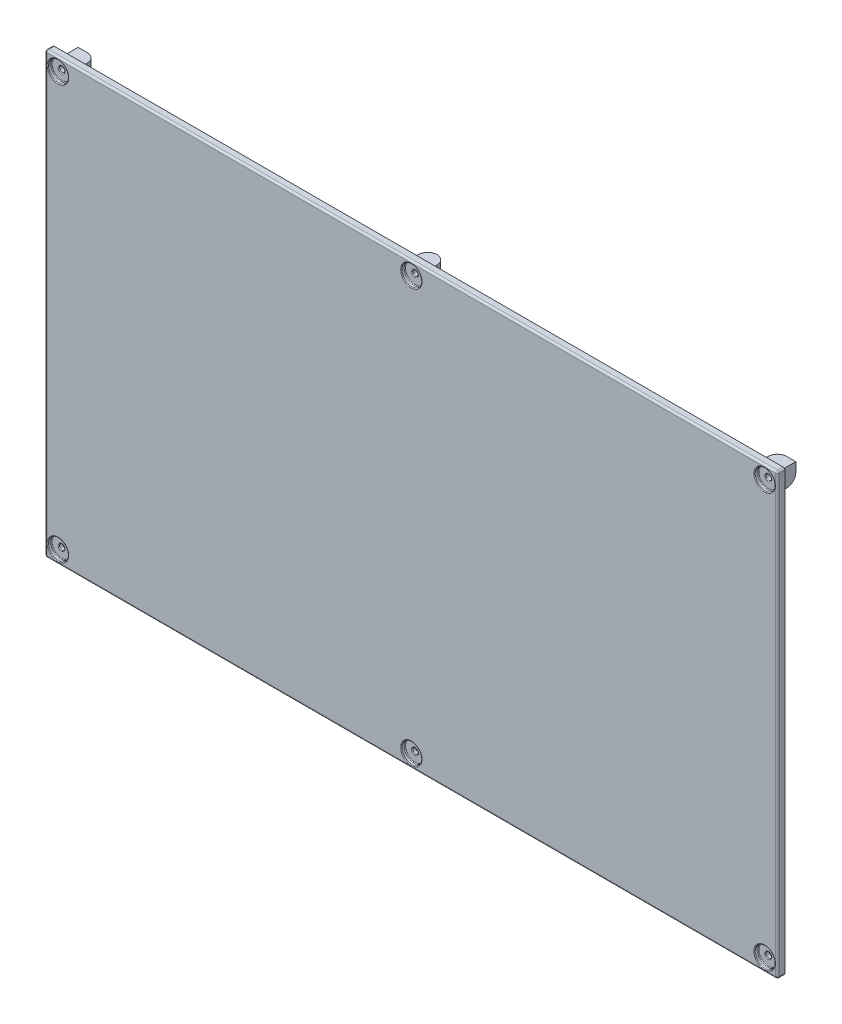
ISO-10303-21;
HEADER;
FILE_DESCRIPTION(('STEP AP214'),'2;1');
FILE_NAME('part.step','',(''),(''),'','','');
FILE_SCHEMA(('AUTOMOTIVE_DESIGN { 1 0 10303 214 1 1 1 1 }'));
ENDSEC;
DATA;
#1=APPLICATION_CONTEXT('core data for automotive mechanical design processes');
#2=APPLICATION_PROTOCOL_DEFINITION('international standard','automotive_design',2000,#1);
#3=PRODUCT_CONTEXT('',#1,'mechanical');
#4=PRODUCT('Part','Part','',(#3));
#5=PRODUCT_RELATED_PRODUCT_CATEGORY('part','',(#4));
#6=PRODUCT_DEFINITION_FORMATION('','',#4);
#7=PRODUCT_DEFINITION_CONTEXT('part definition',#1,'design');
#8=PRODUCT_DEFINITION('design','',#6,#7);
#9=PRODUCT_DEFINITION_SHAPE('','',#8);
#10=(LENGTH_UNIT() NAMED_UNIT(*) SI_UNIT(.MILLI.,.METRE.));
#11=(NAMED_UNIT(*) PLANE_ANGLE_UNIT() SI_UNIT($,.RADIAN.));
#12=(NAMED_UNIT(*) SI_UNIT($,.STERADIAN.) SOLID_ANGLE_UNIT());
#13=UNCERTAINTY_MEASURE_WITH_UNIT(LENGTH_MEASURE(1.E-05),#10,'distance_accuracy_value','');
#14=(GEOMETRIC_REPRESENTATION_CONTEXT(3) GLOBAL_UNCERTAINTY_ASSIGNED_CONTEXT((#13)) GLOBAL_UNIT_ASSIGNED_CONTEXT((#10,
#11,#12)) REPRESENTATION_CONTEXT('',''));
#15=CARTESIAN_POINT('',(0.,0.,0.));
#16=DIRECTION('',(0.,0.,1.));
#17=DIRECTION('',(1.,0.,0.));
#18=AXIS2_PLACEMENT_3D('',#15,#16,#17);
#19=CARTESIAN_POINT('',(0.,0.,0.));
#20=DIRECTION('',(0.,0.,-1.));
#21=DIRECTION('',(-1.,0.,0.));
#22=AXIS2_PLACEMENT_3D('',#19,#20,#21);
#23=PLANE('',#22);
#24=DIRECTION('',(-1.,0.,0.));
#25=VECTOR('',#24,1.);
#26=CARTESIAN_POINT('',(0.,110.5,0.));
#27=LINE('',#26,#25);
#28=CARTESIAN_POINT('',(195.5,110.5,0.));
#29=VERTEX_POINT('',#28);
#30=CARTESIAN_POINT('',(198.,110.5,0.));
#31=VERTEX_POINT('',#30);
#32=EDGE_CURVE('E299',#29,#31,#27,.F.);
#33=ORIENTED_EDGE('',*,*,#32,.T.);
#34=DIRECTION('',(0.,-1.,0.));
#35=VECTOR('',#34,1.);
#36=CARTESIAN_POINT('',(198.,118.,0.));
#37=LINE('',#36,#35);
#38=CARTESIAN_POINT('',(198.,118.,0.));
#39=VERTEX_POINT('',#38);
#40=EDGE_CURVE('E646',#39,#31,#37,.T.);
#41=ORIENTED_EDGE('',*,*,#40,.F.);
#42=DIRECTION('',(1.,0.,0.));
#43=VECTOR('',#42,1.);
#44=CARTESIAN_POINT('',(193.,118.,0.));
#45=LINE('',#44,#43);
#46=CARTESIAN_POINT('',(190.5,118.,0.));
#47=VERTEX_POINT('',#46);
#48=EDGE_CURVE('E635',#47,#39,#45,.T.);
#49=ORIENTED_EDGE('',*,*,#48,.F.);
#50=DIRECTION('',(0.,1.,0.));
#51=VECTOR('',#50,1.);
#52=CARTESIAN_POINT('',(190.5,0.,0.));
#53=LINE('',#52,#51);
#54=CARTESIAN_POINT('',(190.5,115.5,0.));
#55=VERTEX_POINT('',#54);
#56=EDGE_CURVE('E303',#47,#55,#53,.F.);
#57=ORIENTED_EDGE('',*,*,#56,.T.);
#58=CARTESIAN_POINT('',(195.5,115.5,0.));
#59=DIRECTION('',(0.,0.,-1.));
#60=DIRECTION('',(-1.,0.,0.));
#61=AXIS2_PLACEMENT_3D('',#58,#59,#60);
#62=CIRCLE('',#61,5.);
#63=EDGE_CURVE('E140',#29,#55,#62,.T.);
#64=ORIENTED_EDGE('',*,*,#63,.F.);
#65=EDGE_LOOP('',(#33,#41,#49,#57,#64));
#66=FACE_BOUND('',#65,.T.);
#67=DIRECTION('',(-1.,0.,0.));
#68=VECTOR('',#67,1.);
#69=CARTESIAN_POINT('',(0.,120.,0.));
#70=LINE('',#69,#68);
#71=CARTESIAN_POINT('',(199.5,120.,0.));
#72=VERTEX_POINT('',#71);
#73=CARTESIAN_POINT('',(0.499999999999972,120.,0.));
#74=VERTEX_POINT('',#73);
#75=EDGE_CURVE('E595',#72,#74,#70,.T.);
#76=ORIENTED_EDGE('',*,*,#75,.F.);
#77=CARTESIAN_POINT('',(199.5,119.5,0.));
#78=DIRECTION('',(0.,0.,-1.));
#79=DIRECTION('',(-1.,0.,0.));
#80=AXIS2_PLACEMENT_3D('',#77,#78,#79);
#81=CIRCLE('',#80,0.5);
#82=CARTESIAN_POINT('',(200.,119.5,0.));
#83=VERTEX_POINT('',#82);
#84=EDGE_CURVE('E321',#72,#83,#81,.T.);
#85=ORIENTED_EDGE('',*,*,#84,.T.);
#86=DIRECTION('',(0.,1.,0.));
#87=VECTOR('',#86,1.);
#88=CARTESIAN_POINT('',(200.,0.,0.));
#89=LINE('',#88,#87);
#90=CARTESIAN_POINT('',(200.,0.5,0.));
#91=VERTEX_POINT('',#90);
#92=EDGE_CURVE('E611',#91,#83,#89,.T.);
#93=ORIENTED_EDGE('',*,*,#92,.F.);
#94=CARTESIAN_POINT('',(199.5,0.5,0.));
#95=DIRECTION('',(0.,0.,-1.));
#96=DIRECTION('',(-1.,0.,0.));
#97=AXIS2_PLACEMENT_3D('',#94,#95,#96);
#98=CIRCLE('',#97,0.5);
#99=CARTESIAN_POINT('',(199.5,0.,0.));
#100=VERTEX_POINT('',#99);
#101=EDGE_CURVE('E375',#91,#100,#98,.T.);
#102=ORIENTED_EDGE('',*,*,#101,.T.);
#103=DIRECTION('',(1.,0.,0.));
#104=VECTOR('',#103,1.);
#105=CARTESIAN_POINT('',(0.,0.,0.));
#106=LINE('',#105,#104);
#107=CARTESIAN_POINT('',(0.5,0.,0.));
#108=VERTEX_POINT('',#107);
#109=EDGE_CURVE('E615',#108,#100,#106,.T.);
#110=ORIENTED_EDGE('',*,*,#109,.F.);
#111=CARTESIAN_POINT('',(0.5,0.5,0.));
#112=DIRECTION('',(0.,0.,-1.));
#113=DIRECTION('',(-1.,0.,0.));
#114=AXIS2_PLACEMENT_3D('',#111,#112,#113);
#115=CIRCLE('',#114,0.5);
#116=CARTESIAN_POINT('',(0.,0.5,0.));
#117=VERTEX_POINT('',#116);
#118=EDGE_CURVE('E379',#108,#117,#115,.T.);
#119=ORIENTED_EDGE('',*,*,#118,.T.);
#120=DIRECTION('',(0.,-1.,0.));
#121=VECTOR('',#120,1.);
#122=CARTESIAN_POINT('',(0.,0.,0.));
#123=LINE('',#122,#121);
#124=CARTESIAN_POINT('',(0.,119.5,0.));
#125=VERTEX_POINT('',#124);
#126=EDGE_CURVE('E600',#125,#117,#123,.T.);
#127=ORIENTED_EDGE('',*,*,#126,.F.);
#128=CARTESIAN_POINT('',(0.499999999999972,119.5,0.));
#129=DIRECTION('',(0.,0.,-1.));
#130=DIRECTION('',(-1.,0.,0.));
#131=AXIS2_PLACEMENT_3D('',#128,#129,#130);
#132=CIRCLE('',#131,0.5);
#133=EDGE_CURVE('E383',#125,#74,#132,.T.);
#134=ORIENTED_EDGE('',*,*,#133,.T.);
#135=EDGE_LOOP('',(#76,#85,#93,#102,#110,#119,#127,#134));
#136=FACE_BOUND('',#135,.T.);
#137=CARTESIAN_POINT('',(196.5,3.49999999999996,0.));
#138=DIRECTION('',(0.,0.,-1.));
#139=DIRECTION('',(-1.,0.,0.));
#140=AXIS2_PLACEMENT_3D('',#137,#138,#139);
#141=CIRCLE('',#140,0.750000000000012);
#142=CARTESIAN_POINT('',(195.75,3.49999999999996,0.));
#143=VERTEX_POINT('',#142);
#144=EDGE_CURVE('E326',#143,#143,#141,.T.);
#145=ORIENTED_EDGE('',*,*,#144,.F.);
#146=EDGE_LOOP('',(#145));
#147=FACE_BOUND('',#146,.T.);
#148=CARTESIAN_POINT('',(100.,3.5,0.));
#149=DIRECTION('',(0.,0.,-1.));
#150=DIRECTION('',(-1.,0.,0.));
#151=AXIS2_PLACEMENT_3D('',#148,#149,#150);
#152=CIRCLE('',#151,0.749999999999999);
#153=CARTESIAN_POINT('',(99.25,3.5,0.));
#154=VERTEX_POINT('',#153);
#155=EDGE_CURVE('E601',#154,#154,#152,.T.);
#156=ORIENTED_EDGE('',*,*,#155,.F.);
#157=EDGE_LOOP('',(#156));
#158=FACE_BOUND('',#157,.T.);
#159=CARTESIAN_POINT('',(3.49999999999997,3.5,0.));
#160=DIRECTION('',(0.,0.,-1.));
#161=DIRECTION('',(-1.,0.,0.));
#162=AXIS2_PLACEMENT_3D('',#159,#160,#161);
#163=CIRCLE('',#162,0.75);
#164=CARTESIAN_POINT('',(2.74999999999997,3.5,0.));
#165=VERTEX_POINT('',#164);
#166=EDGE_CURVE('E596',#165,#165,#163,.T.);
#167=ORIENTED_EDGE('',*,*,#166,.F.);
#168=EDGE_LOOP('',(#167));
#169=FACE_BOUND('',#168,.T.);
#170=DIRECTION('',(0.,1.,0.));
#171=VECTOR('',#170,1.);
#172=CARTESIAN_POINT('',(1.99999999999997,118.,0.));
#173=LINE('',#172,#171);
#174=CARTESIAN_POINT('',(1.99999999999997,110.5,0.));
#175=VERTEX_POINT('',#174);
#176=CARTESIAN_POINT('',(1.99999999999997,118.,0.));
#177=VERTEX_POINT('',#176);
#178=EDGE_CURVE('E631',#175,#177,#173,.T.);
#179=ORIENTED_EDGE('',*,*,#178,.F.);
#180=DIRECTION('',(-1.,0.,0.));
#181=VECTOR('',#180,1.);
#182=CARTESIAN_POINT('',(0.,110.5,0.));
#183=LINE('',#182,#181);
#184=CARTESIAN_POINT('',(4.49999999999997,110.5,0.));
#185=VERTEX_POINT('',#184);
#186=EDGE_CURVE('E271',#175,#185,#183,.F.);
#187=ORIENTED_EDGE('',*,*,#186,.T.);
#188=CARTESIAN_POINT('',(4.49999999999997,115.5,0.));
#189=DIRECTION('',(0.,0.,-1.));
#190=DIRECTION('',(-1.,0.,0.));
#191=AXIS2_PLACEMENT_3D('',#188,#189,#190);
#192=CIRCLE('',#191,5.);
#193=CARTESIAN_POINT('',(9.49999999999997,115.5,0.));
#194=VERTEX_POINT('',#193);
#195=EDGE_CURVE('E275',#194,#185,#192,.T.);
#196=ORIENTED_EDGE('',*,*,#195,.F.);
#197=DIRECTION('',(0.,-1.,0.));
#198=VECTOR('',#197,1.);
#199=CARTESIAN_POINT('',(9.49999999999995,0.,0.));
#200=LINE('',#199,#198);
#201=CARTESIAN_POINT('',(9.49999999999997,118.,0.));
#202=VERTEX_POINT('',#201);
#203=EDGE_CURVE('E279',#194,#202,#200,.F.);
#204=ORIENTED_EDGE('',*,*,#203,.T.);
#205=DIRECTION('',(1.,0.,0.));
#206=VECTOR('',#205,1.);
#207=CARTESIAN_POINT('',(6.99999999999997,118.,0.));
#208=LINE('',#207,#206);
#209=EDGE_CURVE('E626',#177,#202,#208,.T.);
#210=ORIENTED_EDGE('',*,*,#209,.F.);
#211=EDGE_LOOP('',(#179,#187,#196,#204,#210));
#212=FACE_BOUND('',#211,.T.);
#213=DIRECTION('',(0.,-1.,0.));
#214=VECTOR('',#213,1.);
#215=CARTESIAN_POINT('',(105.,0.,0.));
#216=LINE('',#215,#214);
#217=CARTESIAN_POINT('',(105.,115.5,0.));
#218=VERTEX_POINT('',#217);
#219=CARTESIAN_POINT('',(105.,118.,0.));
#220=VERTEX_POINT('',#219);
#221=EDGE_CURVE('E283',#218,#220,#216,.F.);
#222=ORIENTED_EDGE('',*,*,#221,.T.);
#223=DIRECTION('',(1.,0.,0.));
#224=VECTOR('',#223,1.);
#225=CARTESIAN_POINT('',(102.5,118.,0.));
#226=LINE('',#225,#224);
#227=CARTESIAN_POINT('',(95.0000000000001,118.,0.));
#228=VERTEX_POINT('',#227);
#229=EDGE_CURVE('E202',#228,#220,#226,.T.);
#230=ORIENTED_EDGE('',*,*,#229,.F.);
#231=DIRECTION('',(0.,1.,0.));
#232=VECTOR('',#231,1.);
#233=CARTESIAN_POINT('',(95.0000000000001,0.,0.));
#234=LINE('',#233,#232);
#235=CARTESIAN_POINT('',(95.0000000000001,115.5,0.));
#236=VERTEX_POINT('',#235);
#237=EDGE_CURVE('E291',#228,#236,#234,.F.);
#238=ORIENTED_EDGE('',*,*,#237,.T.);
#239=CARTESIAN_POINT('',(100.,115.5,0.));
#240=DIRECTION('',(0.,0.,-1.));
#241=DIRECTION('',(-1.,0.,0.));
#242=AXIS2_PLACEMENT_3D('',#239,#240,#241);
#243=CIRCLE('',#242,5.);
#244=CARTESIAN_POINT('',(100.,110.5,0.));
#245=VERTEX_POINT('',#244);
#246=EDGE_CURVE('E295',#245,#236,#243,.T.);
#247=ORIENTED_EDGE('',*,*,#246,.F.);
#248=CARTESIAN_POINT('',(100.,115.5,0.));
#249=DIRECTION('',(0.,0.,-1.));
#250=DIRECTION('',(-1.,0.,0.));
#251=AXIS2_PLACEMENT_3D('',#248,#249,#250);
#252=CIRCLE('',#251,5.);
#253=EDGE_CURVE('E287',#218,#245,#252,.T.);
#254=ORIENTED_EDGE('',*,*,#253,.F.);
#255=EDGE_LOOP('',(#222,#230,#238,#247,#254));
#256=FACE_BOUND('',#255,.T.);
#257=ADVANCED_FACE('F45',(#66,#136,#147,#158,#169,#212,#256),#23,.T.);
#258=CARTESIAN_POINT('',(3.49999999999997,116.5,-5.));
#259=DIRECTION('',(0.,0.,1.));
#260=DIRECTION('',(1.,0.,0.));
#261=AXIS2_PLACEMENT_3D('',#258,#259,#260);
#262=CYLINDRICAL_SURFACE('',#261,0.75);
#263=CARTESIAN_POINT('',(3.49999999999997,116.5,0.8));
#264=DIRECTION('',(0.,0.,1.));
#265=DIRECTION('',(1.,0.,0.));
#266=AXIS2_PLACEMENT_3D('',#263,#264,#265);
#267=CIRCLE('',#266,0.75);
#268=CARTESIAN_POINT('',(4.24999999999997,116.5,0.8));
#269=VERTEX_POINT('',#268);
#270=EDGE_CURVE('E459',#269,#269,#267,.T.);
#271=ORIENTED_EDGE('',*,*,#270,.T.);
#272=EDGE_LOOP('',(#271));
#273=FACE_BOUND('',#272,.T.);
#274=CARTESIAN_POINT('',(3.49999999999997,116.5,-5.));
#275=DIRECTION('',(0.,0.,1.));
#276=DIRECTION('',(1.,0.,0.));
#277=AXIS2_PLACEMENT_3D('',#274,#275,#276);
#278=CIRCLE('',#277,0.749999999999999);
#279=CARTESIAN_POINT('',(4.24999999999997,116.5,-5.));
#280=VERTEX_POINT('',#279);
#281=EDGE_CURVE('E154',#280,#280,#278,.T.);
#282=ORIENTED_EDGE('',*,*,#281,.F.);
#283=EDGE_LOOP('',(#282));
#284=FACE_BOUND('',#283,.T.);
#285=ADVANCED_FACE('F698',(#273,#284),#262,.F.);
#286=CARTESIAN_POINT('',(196.5,3.49999999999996,-5.));
#287=DIRECTION('',(0.,0.,1.));
#288=DIRECTION('',(1.,0.,0.));
#289=AXIS2_PLACEMENT_3D('',#286,#287,#288);
#290=CYLINDRICAL_SURFACE('',#289,0.750000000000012);
#291=CARTESIAN_POINT('',(196.5,3.49999999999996,0.8));
#292=DIRECTION('',(0.,0.,1.));
#293=DIRECTION('',(1.,0.,0.));
#294=AXIS2_PLACEMENT_3D('',#291,#292,#293);
#295=CIRCLE('',#294,0.750000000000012);
#296=CARTESIAN_POINT('',(197.25,3.49999999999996,0.8));
#297=VERTEX_POINT('',#296);
#298=EDGE_CURVE('E519',#297,#297,#295,.T.);
#299=ORIENTED_EDGE('',*,*,#298,.T.);
#300=EDGE_LOOP('',(#299));
#301=FACE_BOUND('',#300,.T.);
#302=ORIENTED_EDGE('',*,*,#144,.T.);
#303=EDGE_LOOP('',(#302));
#304=FACE_BOUND('',#303,.T.);
#305=ADVANCED_FACE('F694',(#301,#304),#290,.F.);
#306=CARTESIAN_POINT('',(100.,3.5,-5.));
#307=DIRECTION('',(0.,0.,1.));
#308=DIRECTION('',(1.,0.,0.));
#309=AXIS2_PLACEMENT_3D('',#306,#307,#308);
#310=CYLINDRICAL_SURFACE('',#309,0.749999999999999);
#311=CARTESIAN_POINT('',(100.,3.5,0.8));
#312=DIRECTION('',(0.,0.,1.));
#313=DIRECTION('',(1.,0.,0.));
#314=AXIS2_PLACEMENT_3D('',#311,#312,#313);
#315=CIRCLE('',#314,0.749999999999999);
#316=CARTESIAN_POINT('',(100.75,3.5,0.8));
#317=VERTEX_POINT('',#316);
#318=EDGE_CURVE('E531',#317,#317,#315,.T.);
#319=ORIENTED_EDGE('',*,*,#318,.T.);
#320=EDGE_LOOP('',(#319));
#321=FACE_BOUND('',#320,.T.);
#322=ORIENTED_EDGE('',*,*,#155,.T.);
#323=EDGE_LOOP('',(#322));
#324=FACE_BOUND('',#323,.T.);
#325=ADVANCED_FACE('F697',(#321,#324),#310,.F.);
#326=CARTESIAN_POINT('',(0.,0.,2.));
#327=DIRECTION('',(1.,0.,0.));
#328=DIRECTION('',(0.,1.,0.));
#329=AXIS2_PLACEMENT_3D('',#326,#327,#328);
#330=PLANE('',#329);
#331=ORIENTED_EDGE('',*,*,#126,.T.);
#332=DIRECTION('',(0.,0.,-1.));
#333=VECTOR('',#332,1.);
#334=CARTESIAN_POINT('',(0.,0.5,2.));
#335=LINE('',#334,#333);
#336=CARTESIAN_POINT('',(0.,0.5,1.5));
#337=VERTEX_POINT('',#336);
#338=EDGE_CURVE('E387',#117,#337,#335,.F.);
#339=ORIENTED_EDGE('',*,*,#338,.T.);
#340=DIRECTION('',(0.,-1.,0.));
#341=VECTOR('',#340,1.);
#342=CARTESIAN_POINT('',(0.,0.,1.5));
#343=LINE('',#342,#341);
#344=CARTESIAN_POINT('',(0.,119.5,1.5));
#345=VERTEX_POINT('',#344);
#346=EDGE_CURVE('E391',#337,#345,#343,.F.);
#347=ORIENTED_EDGE('',*,*,#346,.T.);
#348=DIRECTION('',(0.,0.,-1.));
#349=VECTOR('',#348,1.);
#350=CARTESIAN_POINT('',(0.,119.5,2.));
#351=LINE('',#350,#349);
#352=EDGE_CURVE('E395',#345,#125,#351,.T.);
#353=ORIENTED_EDGE('',*,*,#352,.T.);
#354=EDGE_LOOP('',(#331,#339,#347,#353));
#355=FACE_BOUND('',#354,.T.);
#356=ADVANCED_FACE('F702',(#355),#330,.F.);
#357=CARTESIAN_POINT('',(0.,0.,2.));
#358=DIRECTION('',(0.,1.,0.));
#359=DIRECTION('',(0.,0.,1.));
#360=AXIS2_PLACEMENT_3D('',#357,#358,#359);
#361=PLANE('',#360);
#362=ORIENTED_EDGE('',*,*,#109,.T.);
#363=DIRECTION('',(0.,0.,-1.));
#364=VECTOR('',#363,1.);
#365=CARTESIAN_POINT('',(199.5,0.,2.));
#366=LINE('',#365,#364);
#367=CARTESIAN_POINT('',(199.5,0.,1.5));
#368=VERTEX_POINT('',#367);
#369=EDGE_CURVE('E411',#100,#368,#366,.F.);
#370=ORIENTED_EDGE('',*,*,#369,.T.);
#371=DIRECTION('',(1.,0.,0.));
#372=VECTOR('',#371,1.);
#373=CARTESIAN_POINT('',(0.,0.,1.5));
#374=LINE('',#373,#372);
#375=CARTESIAN_POINT('',(0.5,0.,1.5));
#376=VERTEX_POINT('',#375);
#377=EDGE_CURVE('E415',#368,#376,#374,.F.);
#378=ORIENTED_EDGE('',*,*,#377,.T.);
#379=DIRECTION('',(0.,0.,-1.));
#380=VECTOR('',#379,1.);
#381=CARTESIAN_POINT('',(0.5,0.,2.));
#382=LINE('',#381,#380);
#383=EDGE_CURVE('E419',#376,#108,#382,.T.);
#384=ORIENTED_EDGE('',*,*,#383,.T.);
#385=EDGE_LOOP('',(#362,#370,#378,#384));
#386=FACE_BOUND('',#385,.T.);
#387=ADVANCED_FACE('F724',(#386),#361,.F.);
#388=CARTESIAN_POINT('',(200.,0.,2.));
#389=DIRECTION('',(-1.,0.,0.));
#390=DIRECTION('',(0.,-1.,0.));
#391=AXIS2_PLACEMENT_3D('',#388,#389,#390);
#392=PLANE('',#391);
#393=ORIENTED_EDGE('',*,*,#92,.T.);
#394=DIRECTION('',(0.,0.,-1.));
#395=VECTOR('',#394,1.);
#396=CARTESIAN_POINT('',(200.,119.5,2.));
#397=LINE('',#396,#395);
#398=CARTESIAN_POINT('',(200.,119.5,1.5));
#399=VERTEX_POINT('',#398);
#400=EDGE_CURVE('E423',#83,#399,#397,.F.);
#401=ORIENTED_EDGE('',*,*,#400,.T.);
#402=DIRECTION('',(0.,1.,0.));
#403=VECTOR('',#402,1.);
#404=CARTESIAN_POINT('',(200.,0.,1.5));
#405=LINE('',#404,#403);
#406=CARTESIAN_POINT('',(200.,0.5,1.5));
#407=VERTEX_POINT('',#406);
#408=EDGE_CURVE('E427',#399,#407,#405,.F.);
#409=ORIENTED_EDGE('',*,*,#408,.T.);
#410=DIRECTION('',(0.,0.,-1.));
#411=VECTOR('',#410,1.);
#412=CARTESIAN_POINT('',(200.,0.5,2.));
#413=LINE('',#412,#411);
#414=EDGE_CURVE('E431',#407,#91,#413,.T.);
#415=ORIENTED_EDGE('',*,*,#414,.T.);
#416=EDGE_LOOP('',(#393,#401,#409,#415));
#417=FACE_BOUND('',#416,.T.);
#418=ADVANCED_FACE('F720',(#417),#392,.F.);
#419=CARTESIAN_POINT('',(0.,120.,2.));
#420=DIRECTION('',(0.,-1.,0.));
#421=DIRECTION('',(0.,0.,-1.));
#422=AXIS2_PLACEMENT_3D('',#419,#420,#421);
#423=PLANE('',#422);
#424=DIRECTION('',(-1.,0.,0.));
#425=VECTOR('',#424,1.);
#426=CARTESIAN_POINT('',(0.,120.,1.5));
#427=LINE('',#426,#425);
#428=CARTESIAN_POINT('',(0.499999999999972,120.,1.5));
#429=VERTEX_POINT('',#428);
#430=CARTESIAN_POINT('',(199.5,120.,1.5));
#431=VERTEX_POINT('',#430);
#432=EDGE_CURVE('E403',#429,#431,#427,.F.);
#433=ORIENTED_EDGE('',*,*,#432,.T.);
#434=DIRECTION('',(0.,0.,-1.));
#435=VECTOR('',#434,1.);
#436=CARTESIAN_POINT('',(199.5,120.,2.));
#437=LINE('',#436,#435);
#438=EDGE_CURVE('E399',#431,#72,#437,.T.);
#439=ORIENTED_EDGE('',*,*,#438,.T.);
#440=ORIENTED_EDGE('',*,*,#75,.T.);
#441=DIRECTION('',(0.,0.,-1.));
#442=VECTOR('',#441,1.);
#443=CARTESIAN_POINT('',(0.499999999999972,120.,2.));
#444=LINE('',#443,#442);
#445=EDGE_CURVE('E407',#74,#429,#444,.F.);
#446=ORIENTED_EDGE('',*,*,#445,.T.);
#447=EDGE_LOOP('',(#433,#439,#440,#446));
#448=FACE_BOUND('',#447,.T.);
#449=ADVANCED_FACE('F713',(#448),#423,.F.);
#450=CARTESIAN_POINT('',(0.,0.,2.));
#451=DIRECTION('',(0.,0.,-1.));
#452=DIRECTION('',(-1.,0.,0.));
#453=AXIS2_PLACEMENT_3D('',#450,#451,#452);
#454=PLANE('',#453);
#455=DIRECTION('',(1.,0.,0.));
#456=VECTOR('',#455,1.);
#457=CARTESIAN_POINT('',(0.,0.5,2.));
#458=LINE('',#457,#456);
#459=CARTESIAN_POINT('',(0.5,0.5,2.));
#460=VERTEX_POINT('',#459);
#461=CARTESIAN_POINT('',(199.5,0.5,2.));
#462=VERTEX_POINT('',#461);
#463=EDGE_CURVE('E439',#460,#462,#458,.T.);
#464=ORIENTED_EDGE('',*,*,#463,.T.);
#465=DIRECTION('',(0.,1.,0.));
#466=VECTOR('',#465,1.);
#467=CARTESIAN_POINT('',(199.5,0.,2.));
#468=LINE('',#467,#466);
#469=CARTESIAN_POINT('',(199.5,119.5,2.));
#470=VERTEX_POINT('',#469);
#471=EDGE_CURVE('E435',#462,#470,#468,.T.);
#472=ORIENTED_EDGE('',*,*,#471,.T.);
#473=DIRECTION('',(-1.,0.,0.));
#474=VECTOR('',#473,1.);
#475=CARTESIAN_POINT('',(0.,119.5,2.));
#476=LINE('',#475,#474);
#477=CARTESIAN_POINT('',(0.499999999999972,119.5,2.));
#478=VERTEX_POINT('',#477);
#479=EDGE_CURVE('E443',#470,#478,#476,.T.);
#480=ORIENTED_EDGE('',*,*,#479,.T.);
#481=DIRECTION('',(0.,-1.,0.));
#482=VECTOR('',#481,1.);
#483=CARTESIAN_POINT('',(0.5,0.,2.));
#484=LINE('',#483,#482);
#485=EDGE_CURVE('E447',#478,#460,#484,.T.);
#486=ORIENTED_EDGE('',*,*,#485,.T.);
#487=EDGE_LOOP('',(#464,#472,#480,#486));
#488=FACE_BOUND('',#487,.T.);
#489=CARTESIAN_POINT('',(3.49999999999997,3.5,2.));
#490=DIRECTION('',(0.,0.,-1.));
#491=DIRECTION('',(-1.,0.,0.));
#492=AXIS2_PLACEMENT_3D('',#489,#490,#491);
#493=CIRCLE('',#492,2.95);
#494=CARTESIAN_POINT('',(0.549999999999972,3.5,2.));
#495=VERTEX_POINT('',#494);
#496=EDGE_CURVE('E551',#495,#495,#493,.T.);
#497=ORIENTED_EDGE('',*,*,#496,.T.);
#498=EDGE_LOOP('',(#497));
#499=FACE_BOUND('',#498,.T.);
#500=CARTESIAN_POINT('',(100.,3.5,2.));
#501=DIRECTION('',(0.,0.,-1.));
#502=DIRECTION('',(-1.,0.,0.));
#503=AXIS2_PLACEMENT_3D('',#500,#501,#502);
#504=CIRCLE('',#503,2.95);
#505=CARTESIAN_POINT('',(97.05,3.5,2.));
#506=VERTEX_POINT('',#505);
#507=EDGE_CURVE('E555',#506,#506,#504,.T.);
#508=ORIENTED_EDGE('',*,*,#507,.T.);
#509=EDGE_LOOP('',(#508));
#510=FACE_BOUND('',#509,.T.);
#511=CARTESIAN_POINT('',(196.5,3.49999999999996,2.));
#512=DIRECTION('',(0.,0.,-1.));
#513=DIRECTION('',(-1.,0.,0.));
#514=AXIS2_PLACEMENT_3D('',#511,#512,#513);
#515=CIRCLE('',#514,2.94999999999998);
#516=CARTESIAN_POINT('',(193.55,3.49999999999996,2.));
#517=VERTEX_POINT('',#516);
#518=EDGE_CURVE('E559',#517,#517,#515,.T.);
#519=ORIENTED_EDGE('',*,*,#518,.T.);
#520=EDGE_LOOP('',(#519));
#521=FACE_BOUND('',#520,.T.);
#522=CARTESIAN_POINT('',(196.5,116.5,2.));
#523=DIRECTION('',(0.,0.,-1.));
#524=DIRECTION('',(-1.,0.,0.));
#525=AXIS2_PLACEMENT_3D('',#522,#523,#524);
#526=CIRCLE('',#525,2.94999999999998);
#527=CARTESIAN_POINT('',(193.55,116.5,2.));
#528=VERTEX_POINT('',#527);
#529=EDGE_CURVE('E563',#528,#528,#526,.T.);
#530=ORIENTED_EDGE('',*,*,#529,.T.);
#531=EDGE_LOOP('',(#530));
#532=FACE_BOUND('',#531,.T.);
#533=CARTESIAN_POINT('',(100.,116.5,2.));
#534=DIRECTION('',(0.,0.,-1.));
#535=DIRECTION('',(-1.,0.,0.));
#536=AXIS2_PLACEMENT_3D('',#533,#534,#535);
#537=CIRCLE('',#536,2.95);
#538=CARTESIAN_POINT('',(97.05,116.5,2.));
#539=VERTEX_POINT('',#538);
#540=EDGE_CURVE('E567',#539,#539,#537,.T.);
#541=ORIENTED_EDGE('',*,*,#540,.T.);
#542=EDGE_LOOP('',(#541));
#543=FACE_BOUND('',#542,.T.);
#544=CARTESIAN_POINT('',(3.49999999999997,116.5,2.));
#545=DIRECTION('',(0.,0.,-1.));
#546=DIRECTION('',(-1.,0.,0.));
#547=AXIS2_PLACEMENT_3D('',#544,#545,#546);
#548=CIRCLE('',#547,2.95);
#549=CARTESIAN_POINT('',(0.549999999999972,116.5,2.));
#550=VERTEX_POINT('',#549);
#551=EDGE_CURVE('E571',#550,#550,#548,.T.);
#552=ORIENTED_EDGE('',*,*,#551,.T.);
#553=EDGE_LOOP('',(#552));
#554=FACE_BOUND('',#553,.T.);
#555=ADVANCED_FACE('F685',(#488,#499,#510,#521,#532,#543,#554),#454,.F.);
#556=CARTESIAN_POINT('',(100.,116.5,-5.));
#557=DIRECTION('',(0.,0.,1.));
#558=DIRECTION('',(1.,0.,0.));
#559=AXIS2_PLACEMENT_3D('',#556,#557,#558);
#560=CYLINDRICAL_SURFACE('',#559,0.749999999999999);
#561=CARTESIAN_POINT('',(100.,116.5,0.8));
#562=DIRECTION('',(0.,0.,-1.));
#563=DIRECTION('',(-1.,0.,0.));
#564=AXIS2_PLACEMENT_3D('',#561,#562,#563);
#565=CIRCLE('',#564,0.749999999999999);
#566=CARTESIAN_POINT('',(99.25,116.5,0.8));
#567=VERTEX_POINT('',#566);
#568=EDGE_CURVE('E471',#567,#567,#565,.F.);
#569=ORIENTED_EDGE('',*,*,#568,.T.);
#570=EDGE_LOOP('',(#569));
#571=FACE_BOUND('',#570,.T.);
#572=CARTESIAN_POINT('',(100.,115.75,-5.));
#573=CARTESIAN_POINT('',(99.9587791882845,115.749959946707,-5.00003715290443));
#574=CARTESIAN_POINT('',(99.9175880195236,115.753395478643,-4.99898175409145));
#575=CARTESIAN_POINT('',(99.8365016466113,115.766899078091,-4.99496742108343));
#576=CARTESIAN_POINT('',(99.7966035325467,115.776950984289,-4.99201312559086));
#577=CARTESIAN_POINT('',(99.7191373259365,115.803368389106,-4.98448092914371));
#578=CARTESIAN_POINT('',(99.681568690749,115.819732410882,-4.97990340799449));
#579=CARTESIAN_POINT('',(99.6096971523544,115.858263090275,-4.96961130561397));
#580=CARTESIAN_POINT('',(99.5753955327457,115.880432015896,-4.96389628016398));
#581=CARTESIAN_POINT('',(99.5100649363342,115.930611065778,-4.95175406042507));
#582=CARTESIAN_POINT('',(99.4791427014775,115.958756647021,-4.94531233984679));
#583=CARTESIAN_POINT('',(99.4223769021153,116.019802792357,-4.93252948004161));
#584=CARTESIAN_POINT('',(99.3965344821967,116.052704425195,-4.92618836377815));
#585=CARTESIAN_POINT('',(99.3500992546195,116.123236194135,-4.91417044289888));
#586=CARTESIAN_POINT('',(99.3296374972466,116.16095598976,-4.9085117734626));
#587=CARTESIAN_POINT('',(99.2953923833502,116.239496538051,-4.89871790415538));
#588=CARTESIAN_POINT('',(99.2816071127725,116.280316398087,-4.894582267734));
#589=CARTESIAN_POINT('',(99.2614919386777,116.362694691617,-4.88845438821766));
#590=CARTESIAN_POINT('',(99.254964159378,116.404200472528,-4.88640539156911));
#591=CARTESIAN_POINT('',(99.2489313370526,116.487765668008,-4.88451394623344));
#592=CARTESIAN_POINT('',(99.2494247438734,116.529824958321,-4.8846710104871));
#593=CARTESIAN_POINT('',(99.2572651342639,116.611692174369,-4.88712372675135));
#594=CARTESIAN_POINT('',(99.2643640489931,116.651526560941,-4.88934196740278));
#595=CARTESIAN_POINT('',(99.2848130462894,116.729410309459,-4.89554182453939));
#596=CARTESIAN_POINT('',(99.2981636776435,116.767459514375,-4.89952359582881));
#597=CARTESIAN_POINT('',(99.3309199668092,116.84130042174,-4.90886369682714));
#598=CARTESIAN_POINT('',(99.3504061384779,116.877054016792,-4.91424015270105));
#599=CARTESIAN_POINT('',(99.3948242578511,116.944866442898,-4.92575501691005));
#600=CARTESIAN_POINT('',(99.4197574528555,116.976924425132,-4.9318935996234));
#601=CARTESIAN_POINT('',(99.4755906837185,117.037840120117,-4.94455444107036));
#602=CARTESIAN_POINT('',(99.5066960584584,117.066508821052,-4.95108202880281));
#603=CARTESIAN_POINT('',(99.5733621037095,117.118272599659,-4.96356007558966));
#604=CARTESIAN_POINT('',(99.6089239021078,117.141366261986,-4.96951038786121));
#605=CARTESIAN_POINT('',(99.6838428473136,117.181441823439,-4.98021901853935));
#606=CARTESIAN_POINT('',(99.7232254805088,117.198378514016,-4.98496844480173));
#607=CARTESIAN_POINT('',(99.8044349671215,117.225312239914,-4.99267109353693));
#608=CARTESIAN_POINT('',(99.8462581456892,117.235319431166,-4.99562694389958));
#609=CARTESIAN_POINT('',(99.9070581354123,117.244453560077,-4.99834060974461));
#610=CARTESIAN_POINT('',(99.9255942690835,117.246533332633,-4.99896174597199));
#611=CARTESIAN_POINT('',(99.9627504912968,117.249305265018,-4.99979140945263));
#612=CARTESIAN_POINT('',(99.9813704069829,117.249999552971,-5.00000056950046));
#613=CARTESIAN_POINT('',(100.,117.25,-5.00000000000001));
#614=B_SPLINE_CURVE_WITH_KNOTS('',3,(#572,#573,#574,#575,#576,#577,#578,#579,#580,#581,#582,
#583,#584,#585,#586,#587,#588,#589,#590,#591,#592,#593,#594,#595,#596,#597,#598,#599,#600,#601,
#602,#603,#604,#605,#606,#607,#608,#609,#610,#611,#612,#613),.UNSPECIFIED.,.F.,.F.,(4,2,2,2,2,2,
2,2,2,2,2,2,2,2,2,2,2,2,2,2,4),(0.,0.12346021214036,0.246619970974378,0.369750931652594,
0.492930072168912,0.619274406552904,0.745647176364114,0.874860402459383,1.0040365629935,
1.12959708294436,1.25512988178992,1.37613073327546,1.49714220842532,1.61981293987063,
1.74251179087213,1.87032332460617,1.99816727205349,2.1269318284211,2.25550726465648,
2.31144879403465,2.36730433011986),.UNSPECIFIED.);
#615=CARTESIAN_POINT('',(100.,115.75,-5.));
#616=VERTEX_POINT('',#615);
#617=CARTESIAN_POINT('',(100.,117.25,-5.));
#618=VERTEX_POINT('',#617);
#619=EDGE_CURVE('E65',#616,#618,#614,.T.);
#620=ORIENTED_EDGE('',*,*,#619,.T.);
#621=CARTESIAN_POINT('',(100.,117.25,-5.));
#622=CARTESIAN_POINT('',(100.041220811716,117.250040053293,-5.00003715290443));
#623=CARTESIAN_POINT('',(100.082411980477,117.246604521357,-4.99898175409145));
#624=CARTESIAN_POINT('',(100.163498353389,117.233100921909,-4.99496742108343));
#625=CARTESIAN_POINT('',(100.203396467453,117.223049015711,-4.99201312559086));
#626=CARTESIAN_POINT('',(100.280862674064,117.196631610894,-4.98448092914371));
#627=CARTESIAN_POINT('',(100.318431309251,117.180267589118,-4.97990340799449));
#628=CARTESIAN_POINT('',(100.390302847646,117.141736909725,-4.96961130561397));
#629=CARTESIAN_POINT('',(100.424604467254,117.119567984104,-4.96389628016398));
#630=CARTESIAN_POINT('',(100.489935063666,117.069388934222,-4.95175406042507));
#631=CARTESIAN_POINT('',(100.520857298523,117.041243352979,-4.94531233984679));
#632=CARTESIAN_POINT('',(100.577623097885,116.980197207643,-4.93252948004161));
#633=CARTESIAN_POINT('',(100.603465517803,116.947295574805,-4.92618836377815));
#634=CARTESIAN_POINT('',(100.649900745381,116.876763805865,-4.91417044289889));
#635=CARTESIAN_POINT('',(100.670362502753,116.83904401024,-4.90851177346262));
#636=CARTESIAN_POINT('',(100.70460761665,116.760503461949,-4.8987179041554));
#637=CARTESIAN_POINT('',(100.718392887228,116.719683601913,-4.89458226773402));
#638=CARTESIAN_POINT('',(100.738508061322,116.637305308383,-4.88845438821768));
#639=CARTESIAN_POINT('',(100.745035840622,116.595799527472,-4.88640539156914));
#640=CARTESIAN_POINT('',(100.751068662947,116.512234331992,-4.88451394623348));
#641=CARTESIAN_POINT('',(100.750575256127,116.470175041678,-4.88467101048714));
#642=CARTESIAN_POINT('',(100.742734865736,116.388307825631,-4.88712372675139));
#643=CARTESIAN_POINT('',(100.735635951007,116.348473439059,-4.88934196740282));
#644=CARTESIAN_POINT('',(100.715186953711,116.270589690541,-4.89554182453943));
#645=CARTESIAN_POINT('',(100.701836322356,116.232540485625,-4.89952359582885));
#646=CARTESIAN_POINT('',(100.669080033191,116.15869957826,-4.90886369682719));
#647=CARTESIAN_POINT('',(100.649593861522,116.122945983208,-4.9142401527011));
#648=CARTESIAN_POINT('',(100.605175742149,116.055133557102,-4.92575501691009));
#649=CARTESIAN_POINT('',(100.580242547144,116.023075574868,-4.93189359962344));
#650=CARTESIAN_POINT('',(100.524409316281,115.962159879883,-4.9445544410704));
#651=CARTESIAN_POINT('',(100.493303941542,115.933491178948,-4.95108202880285));
#652=CARTESIAN_POINT('',(100.42663789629,115.881727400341,-4.9635600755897));
#653=CARTESIAN_POINT('',(100.391076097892,115.858633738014,-4.96951038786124));
#654=CARTESIAN_POINT('',(100.316157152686,115.818558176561,-4.98021901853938));
#655=CARTESIAN_POINT('',(100.276774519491,115.801621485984,-4.98496844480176));
#656=CARTESIAN_POINT('',(100.195565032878,115.774687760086,-4.99267109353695));
#657=CARTESIAN_POINT('',(100.153741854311,115.764680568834,-4.9956269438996));
#658=CARTESIAN_POINT('',(100.092941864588,115.755546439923,-4.99834060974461));
#659=CARTESIAN_POINT('',(100.074405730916,115.753466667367,-4.998961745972));
#660=CARTESIAN_POINT('',(100.037249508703,115.750694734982,-4.99979140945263));
#661=CARTESIAN_POINT('',(100.018629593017,115.750000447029,-5.00000056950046));
#662=CARTESIAN_POINT('',(100.,115.75,-5.00000000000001));
#663=B_SPLINE_CURVE_WITH_KNOTS('',3,(#621,#622,#623,#624,#625,#626,#627,#628,#629,#630,#631,
#632,#633,#634,#635,#636,#637,#638,#639,#640,#641,#642,#643,#644,#645,#646,#647,#648,#649,#650,
#651,#652,#653,#654,#655,#656,#657,#658,#659,#660,#661,#662),.UNSPECIFIED.,.F.,.F.,(4,2,2,2,2,2,
2,2,2,2,2,2,2,2,2,2,2,2,2,2,4),(0.,0.123460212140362,0.24661997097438,0.369750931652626,
0.492930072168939,0.619274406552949,0.745647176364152,0.874860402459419,1.00403656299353,
1.12959708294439,1.25512988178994,1.37613073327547,1.49714220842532,1.61981293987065,
1.74251179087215,1.87032332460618,1.9981672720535,2.12693182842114,2.25550726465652,
2.31144879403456,2.36730433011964),.UNSPECIFIED.);
#664=EDGE_CURVE('E11',#618,#616,#663,.T.);
#665=ORIENTED_EDGE('',*,*,#664,.T.);
#666=EDGE_LOOP('',(#620,#665));
#667=FACE_BOUND('',#666,.T.);
#668=ADVANCED_FACE('F679',(#571,#667),#560,.F.);
#669=CARTESIAN_POINT('',(196.5,116.5,-5.));
#670=DIRECTION('',(0.,0.,1.));
#671=DIRECTION('',(1.,0.,0.));
#672=AXIS2_PLACEMENT_3D('',#669,#670,#671);
#673=CYLINDRICAL_SURFACE('',#672,0.750000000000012);
#674=CARTESIAN_POINT('',(196.5,116.5,0.8));
#675=DIRECTION('',(0.,0.,-1.));
#676=DIRECTION('',(-1.,0.,0.));
#677=AXIS2_PLACEMENT_3D('',#674,#675,#676);
#678=CIRCLE('',#677,0.750000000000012);
#679=CARTESIAN_POINT('',(195.75,116.5,0.8));
#680=VERTEX_POINT('',#679);
#681=EDGE_CURVE('E491',#680,#680,#678,.F.);
#682=ORIENTED_EDGE('',*,*,#681,.T.);
#683=EDGE_LOOP('',(#682));
#684=FACE_BOUND('',#683,.T.);
#685=CARTESIAN_POINT('',(196.5,116.5,-5.));
#686=DIRECTION('',(0.,0.,1.));
#687=DIRECTION('',(1.,0.,0.));
#688=AXIS2_PLACEMENT_3D('',#685,#686,#687);
#689=CIRCLE('',#688,0.749999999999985);
#690=CARTESIAN_POINT('',(197.25,116.5,-5.));
#691=VERTEX_POINT('',#690);
#692=EDGE_CURVE('E674',#691,#691,#689,.T.);
#693=ORIENTED_EDGE('',*,*,#692,.F.);
#694=EDGE_LOOP('',(#693));
#695=FACE_BOUND('',#694,.T.);
#696=ADVANCED_FACE('F684',(#684,#695),#673,.F.);
#697=CARTESIAN_POINT('',(3.49999999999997,3.5,-5.));
#698=DIRECTION('',(0.,0.,1.));
#699=DIRECTION('',(1.,0.,0.));
#700=AXIS2_PLACEMENT_3D('',#697,#698,#699);
#701=CYLINDRICAL_SURFACE('',#700,0.75);
#702=CARTESIAN_POINT('',(3.49999999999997,3.5,0.8));
#703=DIRECTION('',(0.,0.,-1.));
#704=DIRECTION('',(-1.,0.,0.));
#705=AXIS2_PLACEMENT_3D('',#702,#703,#704);
#706=CIRCLE('',#705,0.75);
#707=CARTESIAN_POINT('',(2.74999999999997,3.5,0.8));
#708=VERTEX_POINT('',#707);
#709=EDGE_CURVE('E591',#708,#708,#706,.F.);
#710=ORIENTED_EDGE('',*,*,#709,.T.);
#711=EDGE_LOOP('',(#710));
#712=FACE_BOUND('',#711,.T.);
#713=ORIENTED_EDGE('',*,*,#166,.T.);
#714=EDGE_LOOP('',(#713));
#715=FACE_BOUND('',#714,.T.);
#716=ADVANCED_FACE('F692',(#712,#715),#701,.F.);
#717=CARTESIAN_POINT('',(3.49999999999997,3.5,1.));
#718=DIRECTION('',(0.,0.,-1.));
#719=DIRECTION('',(-1.,0.,0.));
#720=AXIS2_PLACEMENT_3D('',#717,#718,#719);
#721=PLANE('',#720);
#722=CARTESIAN_POINT('',(3.49999999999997,3.5,1.));
#723=DIRECTION('',(0.,0.,-1.));
#724=DIRECTION('',(-1.,0.,0.));
#725=AXIS2_PLACEMENT_3D('',#722,#723,#724);
#726=CIRCLE('',#725,0.95);
#727=CARTESIAN_POINT('',(2.54999999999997,3.5,1.));
#728=VERTEX_POINT('',#727);
#729=EDGE_CURVE('E583',#728,#728,#726,.T.);
#730=ORIENTED_EDGE('',*,*,#729,.T.);
#731=EDGE_LOOP('',(#730));
#732=FACE_BOUND('',#731,.T.);
#733=CARTESIAN_POINT('',(3.49999999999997,3.5,1.));
#734=DIRECTION('',(0.,0.,-1.));
#735=DIRECTION('',(-1.,0.,0.));
#736=AXIS2_PLACEMENT_3D('',#733,#734,#735);
#737=CIRCLE('',#736,2.55);
#738=CARTESIAN_POINT('',(0.949999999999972,3.5,1.));
#739=VERTEX_POINT('',#738);
#740=EDGE_CURVE('E587',#739,#739,#737,.F.);
#741=ORIENTED_EDGE('',*,*,#740,.T.);
#742=EDGE_LOOP('',(#741));
#743=FACE_BOUND('',#742,.T.);
#744=ADVANCED_FACE('F706',(#732,#743),#721,.F.);
#745=CARTESIAN_POINT('',(3.49999999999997,3.5,1.));
#746=DIRECTION('',(0.,0.,1.));
#747=DIRECTION('',(1.,0.,0.));
#748=AXIS2_PLACEMENT_3D('',#745,#746,#747);
#749=CYLINDRICAL_SURFACE('',#748,2.75);
#750=CARTESIAN_POINT('',(3.49999999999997,3.5,1.2));
#751=DIRECTION('',(0.,0.,-1.));
#752=DIRECTION('',(-1.,0.,0.));
#753=AXIS2_PLACEMENT_3D('',#750,#751,#752);
#754=CIRCLE('',#753,2.75);
#755=CARTESIAN_POINT('',(0.749999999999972,3.5,1.2));
#756=VERTEX_POINT('',#755);
#757=EDGE_CURVE('E575',#756,#756,#754,.T.);
#758=ORIENTED_EDGE('',*,*,#757,.T.);
#759=EDGE_LOOP('',(#758));
#760=FACE_BOUND('',#759,.T.);
#761=CARTESIAN_POINT('',(3.49999999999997,3.5,1.8));
#762=DIRECTION('',(0.,0.,-1.));
#763=DIRECTION('',(-1.,0.,0.));
#764=AXIS2_PLACEMENT_3D('',#761,#762,#763);
#765=CIRCLE('',#764,2.75);
#766=CARTESIAN_POINT('',(0.749999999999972,3.5,1.8));
#767=VERTEX_POINT('',#766);
#768=EDGE_CURVE('E579',#767,#767,#765,.F.);
#769=ORIENTED_EDGE('',*,*,#768,.T.);
#770=EDGE_LOOP('',(#769));
#771=FACE_BOUND('',#770,.T.);
#772=ADVANCED_FACE('F1027',(#760,#771),#749,.F.);
#773=CARTESIAN_POINT('',(100.,3.5,1.));
#774=DIRECTION('',(0.,0.,1.));
#775=DIRECTION('',(1.,0.,0.));
#776=AXIS2_PLACEMENT_3D('',#773,#774,#775);
#777=PLANE('',#776);
#778=CARTESIAN_POINT('',(100.,3.5,1.));
#779=DIRECTION('',(0.,0.,1.));
#780=DIRECTION('',(1.,0.,0.));
#781=AXIS2_PLACEMENT_3D('',#778,#779,#780);
#782=CIRCLE('',#781,2.55);
#783=CARTESIAN_POINT('',(102.55,3.5,1.));
#784=VERTEX_POINT('',#783);
#785=EDGE_CURVE('E535',#784,#784,#782,.T.);
#786=ORIENTED_EDGE('',*,*,#785,.T.);
#787=EDGE_LOOP('',(#786));
#788=FACE_BOUND('',#787,.T.);
#789=CARTESIAN_POINT('',(100.,3.5,1.));
#790=DIRECTION('',(0.,0.,1.));
#791=DIRECTION('',(1.,0.,0.));
#792=AXIS2_PLACEMENT_3D('',#789,#790,#791);
#793=CIRCLE('',#792,0.949999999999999);
#794=CARTESIAN_POINT('',(100.95,3.5,1.));
#795=VERTEX_POINT('',#794);
#796=EDGE_CURVE('E539',#795,#795,#793,.F.);
#797=ORIENTED_EDGE('',*,*,#796,.T.);
#798=EDGE_LOOP('',(#797));
#799=FACE_BOUND('',#798,.T.);
#800=ADVANCED_FACE('F1023',(#788,#799),#777,.T.);
#801=CARTESIAN_POINT('',(100.,3.5,1.));
#802=DIRECTION('',(0.,0.,1.));
#803=DIRECTION('',(1.,0.,0.));
#804=AXIS2_PLACEMENT_3D('',#801,#802,#803);
#805=CYLINDRICAL_SURFACE('',#804,2.75);
#806=CARTESIAN_POINT('',(100.,3.5,1.8));
#807=DIRECTION('',(0.,0.,-1.));
#808=DIRECTION('',(-1.,0.,0.));
#809=AXIS2_PLACEMENT_3D('',#806,#807,#808);
#810=CIRCLE('',#809,2.75);
#811=CARTESIAN_POINT('',(97.25,3.5,1.8));
#812=VERTEX_POINT('',#811);
#813=EDGE_CURVE('E543',#812,#812,#810,.F.);
#814=ORIENTED_EDGE('',*,*,#813,.T.);
#815=EDGE_LOOP('',(#814));
#816=FACE_BOUND('',#815,.T.);
#817=CARTESIAN_POINT('',(100.,3.5,1.2));
#818=DIRECTION('',(0.,0.,1.));
#819=DIRECTION('',(1.,0.,0.));
#820=AXIS2_PLACEMENT_3D('',#817,#818,#819);
#821=CIRCLE('',#820,2.75);
#822=CARTESIAN_POINT('',(102.75,3.5,1.2));
#823=VERTEX_POINT('',#822);
#824=EDGE_CURVE('E547',#823,#823,#821,.F.);
#825=ORIENTED_EDGE('',*,*,#824,.T.);
#826=EDGE_LOOP('',(#825));
#827=FACE_BOUND('',#826,.T.);
#828=ADVANCED_FACE('F1019',(#816,#827),#805,.F.);
#829=CARTESIAN_POINT('',(196.5,3.49999999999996,1.));
#830=DIRECTION('',(0.,0.,1.));
#831=DIRECTION('',(1.,0.,0.));
#832=AXIS2_PLACEMENT_3D('',#829,#830,#831);
#833=PLANE('',#832);
#834=CARTESIAN_POINT('',(196.5,3.49999999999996,1.));
#835=DIRECTION('',(0.,0.,1.));
#836=DIRECTION('',(1.,0.,0.));
#837=AXIS2_PLACEMENT_3D('',#834,#835,#836);
#838=CIRCLE('',#837,0.950000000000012);
#839=CARTESIAN_POINT('',(197.45,3.49999999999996,1.));
#840=VERTEX_POINT('',#839);
#841=EDGE_CURVE('E523',#840,#840,#838,.F.);
#842=ORIENTED_EDGE('',*,*,#841,.T.);
#843=EDGE_LOOP('',(#842));
#844=FACE_BOUND('',#843,.T.);
#845=CARTESIAN_POINT('',(196.5,3.49999999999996,1.));
#846=DIRECTION('',(0.,0.,1.));
#847=DIRECTION('',(1.,0.,0.));
#848=AXIS2_PLACEMENT_3D('',#845,#846,#847);
#849=CIRCLE('',#848,2.54999999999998);
#850=CARTESIAN_POINT('',(199.05,3.49999999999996,1.));
#851=VERTEX_POINT('',#850);
#852=EDGE_CURVE('E527',#851,#851,#849,.T.);
#853=ORIENTED_EDGE('',*,*,#852,.T.);
#854=EDGE_LOOP('',(#853));
#855=FACE_BOUND('',#854,.T.);
#856=ADVANCED_FACE('F1015',(#844,#855),#833,.T.);
#857=CARTESIAN_POINT('',(196.5,3.49999999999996,1.));
#858=DIRECTION('',(0.,0.,1.));
#859=DIRECTION('',(1.,0.,0.));
#860=AXIS2_PLACEMENT_3D('',#857,#858,#859);
#861=CYLINDRICAL_SURFACE('',#860,2.74999999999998);
#862=CARTESIAN_POINT('',(196.5,3.49999999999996,1.2));
#863=DIRECTION('',(0.,0.,1.));
#864=DIRECTION('',(1.,0.,0.));
#865=AXIS2_PLACEMENT_3D('',#862,#863,#864);
#866=CIRCLE('',#865,2.74999999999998);
#867=CARTESIAN_POINT('',(199.25,3.49999999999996,1.2));
#868=VERTEX_POINT('',#867);
#869=EDGE_CURVE('E511',#868,#868,#866,.F.);
#870=ORIENTED_EDGE('',*,*,#869,.T.);
#871=EDGE_LOOP('',(#870));
#872=FACE_BOUND('',#871,.T.);
#873=CARTESIAN_POINT('',(196.5,3.49999999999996,1.8));
#874=DIRECTION('',(0.,0.,-1.));
#875=DIRECTION('',(-1.,0.,0.));
#876=AXIS2_PLACEMENT_3D('',#873,#874,#875);
#877=CIRCLE('',#876,2.74999999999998);
#878=CARTESIAN_POINT('',(193.75,3.49999999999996,1.8));
#879=VERTEX_POINT('',#878);
#880=EDGE_CURVE('E515',#879,#879,#877,.F.);
#881=ORIENTED_EDGE('',*,*,#880,.T.);
#882=EDGE_LOOP('',(#881));
#883=FACE_BOUND('',#882,.T.);
#884=ADVANCED_FACE('F1011',(#872,#883),#861,.F.);
#885=CARTESIAN_POINT('',(196.5,116.5,1.));
#886=DIRECTION('',(0.,0.,-1.));
#887=DIRECTION('',(-1.,0.,0.));
#888=AXIS2_PLACEMENT_3D('',#885,#886,#887);
#889=PLANE('',#888);
#890=CARTESIAN_POINT('',(196.5,116.5,1.));
#891=DIRECTION('',(0.,0.,-1.));
#892=DIRECTION('',(-1.,0.,0.));
#893=AXIS2_PLACEMENT_3D('',#890,#891,#892);
#894=CIRCLE('',#893,2.54999999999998);
#895=CARTESIAN_POINT('',(193.95,116.5,1.));
#896=VERTEX_POINT('',#895);
#897=EDGE_CURVE('E495',#896,#896,#894,.F.);
#898=ORIENTED_EDGE('',*,*,#897,.T.);
#899=EDGE_LOOP('',(#898));
#900=FACE_BOUND('',#899,.T.);
#901=CARTESIAN_POINT('',(196.5,116.5,1.));
#902=DIRECTION('',(0.,0.,-1.));
#903=DIRECTION('',(-1.,0.,0.));
#904=AXIS2_PLACEMENT_3D('',#901,#902,#903);
#905=CIRCLE('',#904,0.950000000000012);
#906=CARTESIAN_POINT('',(195.55,116.5,1.));
#907=VERTEX_POINT('',#906);
#908=EDGE_CURVE('E499',#907,#907,#905,.T.);
#909=ORIENTED_EDGE('',*,*,#908,.T.);
#910=EDGE_LOOP('',(#909));
#911=FACE_BOUND('',#910,.T.);
#912=ADVANCED_FACE('F1007',(#900,#911),#889,.F.);
#913=CARTESIAN_POINT('',(196.5,116.5,1.));
#914=DIRECTION('',(0.,0.,1.));
#915=DIRECTION('',(1.,0.,0.));
#916=AXIS2_PLACEMENT_3D('',#913,#914,#915);
#917=CYLINDRICAL_SURFACE('',#916,2.74999999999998);
#918=CARTESIAN_POINT('',(196.5,116.5,1.8));
#919=DIRECTION('',(0.,0.,-1.));
#920=DIRECTION('',(-1.,0.,0.));
#921=AXIS2_PLACEMENT_3D('',#918,#919,#920);
#922=CIRCLE('',#921,2.74999999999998);
#923=CARTESIAN_POINT('',(193.75,116.5,1.8));
#924=VERTEX_POINT('',#923);
#925=EDGE_CURVE('E503',#924,#924,#922,.F.);
#926=ORIENTED_EDGE('',*,*,#925,.T.);
#927=EDGE_LOOP('',(#926));
#928=FACE_BOUND('',#927,.T.);
#929=CARTESIAN_POINT('',(196.5,116.5,1.2));
#930=DIRECTION('',(0.,0.,-1.));
#931=DIRECTION('',(-1.,0.,0.));
#932=AXIS2_PLACEMENT_3D('',#929,#930,#931);
#933=CIRCLE('',#932,2.74999999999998);
#934=CARTESIAN_POINT('',(193.75,116.5,1.2));
#935=VERTEX_POINT('',#934);
#936=EDGE_CURVE('E507',#935,#935,#933,.T.);
#937=ORIENTED_EDGE('',*,*,#936,.T.);
#938=EDGE_LOOP('',(#937));
#939=FACE_BOUND('',#938,.T.);
#940=ADVANCED_FACE('F1003',(#928,#939),#917,.F.);
#941=CARTESIAN_POINT('',(100.,116.5,1.));
#942=DIRECTION('',(0.,0.,-1.));
#943=DIRECTION('',(-1.,0.,0.));
#944=AXIS2_PLACEMENT_3D('',#941,#942,#943);
#945=PLANE('',#944);
#946=CARTESIAN_POINT('',(100.,116.5,1.));
#947=DIRECTION('',(0.,0.,-1.));
#948=DIRECTION('',(-1.,0.,0.));
#949=AXIS2_PLACEMENT_3D('',#946,#947,#948);
#950=CIRCLE('',#949,2.55);
#951=CARTESIAN_POINT('',(97.45,116.5,1.));
#952=VERTEX_POINT('',#951);
#953=EDGE_CURVE('E475',#952,#952,#950,.F.);
#954=ORIENTED_EDGE('',*,*,#953,.T.);
#955=EDGE_LOOP('',(#954));
#956=FACE_BOUND('',#955,.T.);
#957=CARTESIAN_POINT('',(100.,116.5,1.));
#958=DIRECTION('',(0.,0.,-1.));
#959=DIRECTION('',(-1.,0.,0.));
#960=AXIS2_PLACEMENT_3D('',#957,#958,#959);
#961=CIRCLE('',#960,0.949999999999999);
#962=CARTESIAN_POINT('',(99.05,116.5,1.));
#963=VERTEX_POINT('',#962);
#964=EDGE_CURVE('E479',#963,#963,#961,.T.);
#965=ORIENTED_EDGE('',*,*,#964,.T.);
#966=EDGE_LOOP('',(#965));
#967=FACE_BOUND('',#966,.T.);
#968=ADVANCED_FACE('F999',(#956,#967),#945,.F.);
#969=CARTESIAN_POINT('',(100.,116.5,1.));
#970=DIRECTION('',(0.,0.,1.));
#971=DIRECTION('',(1.,0.,0.));
#972=AXIS2_PLACEMENT_3D('',#969,#970,#971);
#973=CYLINDRICAL_SURFACE('',#972,2.75);
#974=CARTESIAN_POINT('',(100.,116.5,1.8));
#975=DIRECTION('',(0.,0.,-1.));
#976=DIRECTION('',(-1.,0.,0.));
#977=AXIS2_PLACEMENT_3D('',#974,#975,#976);
#978=CIRCLE('',#977,2.75);
#979=CARTESIAN_POINT('',(97.25,116.5,1.8));
#980=VERTEX_POINT('',#979);
#981=EDGE_CURVE('E483',#980,#980,#978,.F.);
#982=ORIENTED_EDGE('',*,*,#981,.T.);
#983=EDGE_LOOP('',(#982));
#984=FACE_BOUND('',#983,.T.);
#985=CARTESIAN_POINT('',(100.,116.5,1.2));
#986=DIRECTION('',(0.,0.,-1.));
#987=DIRECTION('',(-1.,0.,0.));
#988=AXIS2_PLACEMENT_3D('',#985,#986,#987);
#989=CIRCLE('',#988,2.75);
#990=CARTESIAN_POINT('',(97.25,116.5,1.2));
#991=VERTEX_POINT('',#990);
#992=EDGE_CURVE('E487',#991,#991,#989,.T.);
#993=ORIENTED_EDGE('',*,*,#992,.T.);
#994=EDGE_LOOP('',(#993));
#995=FACE_BOUND('',#994,.T.);
#996=ADVANCED_FACE('F995',(#984,#995),#973,.F.);
#997=CARTESIAN_POINT('',(3.49999999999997,116.5,1.));
#998=DIRECTION('',(0.,0.,1.));
#999=DIRECTION('',(1.,0.,0.));
#1000=AXIS2_PLACEMENT_3D('',#997,#998,#999);
#1001=PLANE('',#1000);
#1002=CARTESIAN_POINT('',(3.49999999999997,116.5,1.));
#1003=DIRECTION('',(0.,0.,1.));
#1004=DIRECTION('',(1.,0.,0.));
#1005=AXIS2_PLACEMENT_3D('',#1002,#1003,#1004);
#1006=CIRCLE('',#1005,0.95);
#1007=CARTESIAN_POINT('',(4.44999999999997,116.5,1.));
#1008=VERTEX_POINT('',#1007);
#1009=EDGE_CURVE('E463',#1008,#1008,#1006,.F.);
#1010=ORIENTED_EDGE('',*,*,#1009,.T.);
#1011=EDGE_LOOP('',(#1010));
#1012=FACE_BOUND('',#1011,.T.);
#1013=CARTESIAN_POINT('',(3.49999999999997,116.5,1.));
#1014=DIRECTION('',(0.,0.,1.));
#1015=DIRECTION('',(1.,0.,0.));
#1016=AXIS2_PLACEMENT_3D('',#1013,#1014,#1015);
#1017=CIRCLE('',#1016,2.55);
#1018=CARTESIAN_POINT('',(6.04999999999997,116.5,1.));
#1019=VERTEX_POINT('',#1018);
#1020=EDGE_CURVE('E467',#1019,#1019,#1017,.T.);
#1021=ORIENTED_EDGE('',*,*,#1020,.T.);
#1022=EDGE_LOOP('',(#1021));
#1023=FACE_BOUND('',#1022,.T.);
#1024=ADVANCED_FACE('F998',(#1012,#1023),#1001,.T.);
#1025=CARTESIAN_POINT('',(3.49999999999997,116.5,1.));
#1026=DIRECTION('',(0.,0.,1.));
#1027=DIRECTION('',(1.,0.,0.));
#1028=AXIS2_PLACEMENT_3D('',#1025,#1026,#1027);
#1029=CYLINDRICAL_SURFACE('',#1028,2.75);
#1030=CARTESIAN_POINT('',(3.49999999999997,116.5,1.2));
#1031=DIRECTION('',(0.,0.,1.));
#1032=DIRECTION('',(1.,0.,0.));
#1033=AXIS2_PLACEMENT_3D('',#1030,#1031,#1032);
#1034=CIRCLE('',#1033,2.75);
#1035=CARTESIAN_POINT('',(6.24999999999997,116.5,1.2));
#1036=VERTEX_POINT('',#1035);
#1037=EDGE_CURVE('E451',#1036,#1036,#1034,.F.);
#1038=ORIENTED_EDGE('',*,*,#1037,.T.);
#1039=EDGE_LOOP('',(#1038));
#1040=FACE_BOUND('',#1039,.T.);
#1041=CARTESIAN_POINT('',(3.49999999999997,116.5,1.8));
#1042=DIRECTION('',(0.,0.,-1.));
#1043=DIRECTION('',(-1.,0.,0.));
#1044=AXIS2_PLACEMENT_3D('',#1041,#1042,#1043);
#1045=CIRCLE('',#1044,2.75);
#1046=CARTESIAN_POINT('',(0.749999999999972,116.5,1.8));
#1047=VERTEX_POINT('',#1046);
#1048=EDGE_CURVE('E455',#1047,#1047,#1045,.F.);
#1049=ORIENTED_EDGE('',*,*,#1048,.T.);
#1050=EDGE_LOOP('',(#1049));
#1051=FACE_BOUND('',#1050,.T.);
#1052=ADVANCED_FACE('F687',(#1040,#1051),#1029,.F.);
#1053=CARTESIAN_POINT('',(3.49999999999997,3.5,0.8));
#1054=DIRECTION('',(0.,0.,-1.));
#1055=DIRECTION('',(-1.,0.,0.));
#1056=AXIS2_PLACEMENT_3D('',#1053,#1054,#1055);
#1057=TOROIDAL_SURFACE('',#1056,0.95,0.2);
#1058=ORIENTED_EDGE('',*,*,#729,.F.);
#1059=EDGE_LOOP('',(#1058));
#1060=FACE_BOUND('',#1059,.T.);
#1061=ORIENTED_EDGE('',*,*,#709,.F.);
#1062=EDGE_LOOP('',(#1061));
#1063=FACE_BOUND('',#1062,.T.);
#1064=ADVANCED_FACE('F732',(#1060,#1063),#1057,.T.);
#1065=CARTESIAN_POINT('',(3.49999999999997,3.5,1.2));
#1066=DIRECTION('',(0.,0.,-1.));
#1067=DIRECTION('',(-1.,0.,0.));
#1068=AXIS2_PLACEMENT_3D('',#1065,#1066,#1067);
#1069=TOROIDAL_SURFACE('',#1068,2.55,0.2);
#1070=ORIENTED_EDGE('',*,*,#757,.F.);
#1071=EDGE_LOOP('',(#1070));
#1072=FACE_BOUND('',#1071,.T.);
#1073=ORIENTED_EDGE('',*,*,#740,.F.);
#1074=EDGE_LOOP('',(#1073));
#1075=FACE_BOUND('',#1074,.T.);
#1076=ADVANCED_FACE('F735',(#1072,#1075),#1069,.F.);
#1077=CARTESIAN_POINT('',(3.49999999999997,3.5,1.8));
#1078=DIRECTION('',(0.,0.,-1.));
#1079=DIRECTION('',(-1.,0.,0.));
#1080=AXIS2_PLACEMENT_3D('',#1077,#1078,#1079);
#1081=TOROIDAL_SURFACE('',#1080,2.95,0.2);
#1082=ORIENTED_EDGE('',*,*,#496,.F.);
#1083=EDGE_LOOP('',(#1082));
#1084=FACE_BOUND('',#1083,.T.);
#1085=ORIENTED_EDGE('',*,*,#768,.F.);
#1086=EDGE_LOOP('',(#1085));
#1087=FACE_BOUND('',#1086,.T.);
#1088=ADVANCED_FACE('F739',(#1084,#1087),#1081,.T.);
#1089=CARTESIAN_POINT('',(100.,3.5,1.8));
#1090=DIRECTION('',(0.,0.,-1.));
#1091=DIRECTION('',(-1.,0.,0.));
#1092=AXIS2_PLACEMENT_3D('',#1089,#1090,#1091);
#1093=TOROIDAL_SURFACE('',#1092,2.95,0.2);
#1094=ORIENTED_EDGE('',*,*,#507,.F.);
#1095=EDGE_LOOP('',(#1094));
#1096=FACE_BOUND('',#1095,.T.);
#1097=ORIENTED_EDGE('',*,*,#813,.F.);
#1098=EDGE_LOOP('',(#1097));
#1099=FACE_BOUND('',#1098,.T.);
#1100=ADVANCED_FACE('F743',(#1096,#1099),#1093,.T.);
#1101=CARTESIAN_POINT('',(100.,3.5,1.2));
#1102=DIRECTION('',(0.,0.,1.));
#1103=DIRECTION('',(1.,0.,0.));
#1104=AXIS2_PLACEMENT_3D('',#1101,#1102,#1103);
#1105=TOROIDAL_SURFACE('',#1104,2.55,0.2);
#1106=ORIENTED_EDGE('',*,*,#824,.F.);
#1107=EDGE_LOOP('',(#1106));
#1108=FACE_BOUND('',#1107,.T.);
#1109=ORIENTED_EDGE('',*,*,#785,.F.);
#1110=EDGE_LOOP('',(#1109));
#1111=FACE_BOUND('',#1110,.T.);
#1112=ADVANCED_FACE('F747',(#1108,#1111),#1105,.F.);
#1113=CARTESIAN_POINT('',(100.,3.5,0.8));
#1114=DIRECTION('',(0.,0.,1.));
#1115=DIRECTION('',(1.,0.,0.));
#1116=AXIS2_PLACEMENT_3D('',#1113,#1114,#1115);
#1117=TOROIDAL_SURFACE('',#1116,0.949999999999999,0.2);
#1118=ORIENTED_EDGE('',*,*,#318,.F.);
#1119=EDGE_LOOP('',(#1118));
#1120=FACE_BOUND('',#1119,.T.);
#1121=ORIENTED_EDGE('',*,*,#796,.F.);
#1122=EDGE_LOOP('',(#1121));
#1123=FACE_BOUND('',#1122,.T.);
#1124=ADVANCED_FACE('F751',(#1120,#1123),#1117,.T.);
#1125=CARTESIAN_POINT('',(196.5,3.49999999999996,0.8));
#1126=DIRECTION('',(0.,0.,1.));
#1127=DIRECTION('',(1.,0.,0.));
#1128=AXIS2_PLACEMENT_3D('',#1125,#1126,#1127);
#1129=TOROIDAL_SURFACE('',#1128,0.950000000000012,0.2);
#1130=ORIENTED_EDGE('',*,*,#298,.F.);
#1131=EDGE_LOOP('',(#1130));
#1132=FACE_BOUND('',#1131,.T.);
#1133=ORIENTED_EDGE('',*,*,#841,.F.);
#1134=EDGE_LOOP('',(#1133));
#1135=FACE_BOUND('',#1134,.T.);
#1136=ADVANCED_FACE('F755',(#1132,#1135),#1129,.T.);
#1137=CARTESIAN_POINT('',(196.5,3.49999999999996,1.2));
#1138=DIRECTION('',(0.,0.,1.));
#1139=DIRECTION('',(1.,0.,0.));
#1140=AXIS2_PLACEMENT_3D('',#1137,#1138,#1139);
#1141=TOROIDAL_SURFACE('',#1140,2.54999999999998,0.2);
#1142=ORIENTED_EDGE('',*,*,#869,.F.);
#1143=EDGE_LOOP('',(#1142));
#1144=FACE_BOUND('',#1143,.T.);
#1145=ORIENTED_EDGE('',*,*,#852,.F.);
#1146=EDGE_LOOP('',(#1145));
#1147=FACE_BOUND('',#1146,.T.);
#1148=ADVANCED_FACE('F759',(#1144,#1147),#1141,.F.);
#1149=CARTESIAN_POINT('',(196.5,3.49999999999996,1.8));
#1150=DIRECTION('',(0.,0.,-1.));
#1151=DIRECTION('',(-1.,0.,0.));
#1152=AXIS2_PLACEMENT_3D('',#1149,#1150,#1151);
#1153=TOROIDAL_SURFACE('',#1152,2.94999999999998,0.2);
#1154=ORIENTED_EDGE('',*,*,#518,.F.);
#1155=EDGE_LOOP('',(#1154));
#1156=FACE_BOUND('',#1155,.T.);
#1157=ORIENTED_EDGE('',*,*,#880,.F.);
#1158=EDGE_LOOP('',(#1157));
#1159=FACE_BOUND('',#1158,.T.);
#1160=ADVANCED_FACE('F763',(#1156,#1159),#1153,.T.);
#1161=CARTESIAN_POINT('',(196.5,116.5,1.8));
#1162=DIRECTION('',(0.,0.,-1.));
#1163=DIRECTION('',(-1.,0.,0.));
#1164=AXIS2_PLACEMENT_3D('',#1161,#1162,#1163);
#1165=TOROIDAL_SURFACE('',#1164,2.94999999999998,0.2);
#1166=ORIENTED_EDGE('',*,*,#529,.F.);
#1167=EDGE_LOOP('',(#1166));
#1168=FACE_BOUND('',#1167,.T.);
#1169=ORIENTED_EDGE('',*,*,#925,.F.);
#1170=EDGE_LOOP('',(#1169));
#1171=FACE_BOUND('',#1170,.T.);
#1172=ADVANCED_FACE('F767',(#1168,#1171),#1165,.T.);
#1173=CARTESIAN_POINT('',(196.5,116.5,1.2));
#1174=DIRECTION('',(0.,0.,-1.));
#1175=DIRECTION('',(-1.,0.,0.));
#1176=AXIS2_PLACEMENT_3D('',#1173,#1174,#1175);
#1177=TOROIDAL_SURFACE('',#1176,2.54999999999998,0.2);
#1178=ORIENTED_EDGE('',*,*,#936,.F.);
#1179=EDGE_LOOP('',(#1178));
#1180=FACE_BOUND('',#1179,.T.);
#1181=ORIENTED_EDGE('',*,*,#897,.F.);
#1182=EDGE_LOOP('',(#1181));
#1183=FACE_BOUND('',#1182,.T.);
#1184=ADVANCED_FACE('F771',(#1180,#1183),#1177,.F.);
#1185=CARTESIAN_POINT('',(196.5,116.5,0.8));
#1186=DIRECTION('',(0.,0.,-1.));
#1187=DIRECTION('',(-1.,0.,0.));
#1188=AXIS2_PLACEMENT_3D('',#1185,#1186,#1187);
#1189=TOROIDAL_SURFACE('',#1188,0.950000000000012,0.2);
#1190=ORIENTED_EDGE('',*,*,#908,.F.);
#1191=EDGE_LOOP('',(#1190));
#1192=FACE_BOUND('',#1191,.T.);
#1193=ORIENTED_EDGE('',*,*,#681,.F.);
#1194=EDGE_LOOP('',(#1193));
#1195=FACE_BOUND('',#1194,.T.);
#1196=ADVANCED_FACE('F775',(#1192,#1195),#1189,.T.);
#1197=CARTESIAN_POINT('',(100.,116.5,1.8));
#1198=DIRECTION('',(0.,0.,-1.));
#1199=DIRECTION('',(-1.,0.,0.));
#1200=AXIS2_PLACEMENT_3D('',#1197,#1198,#1199);
#1201=TOROIDAL_SURFACE('',#1200,2.95,0.2);
#1202=ORIENTED_EDGE('',*,*,#540,.F.);
#1203=EDGE_LOOP('',(#1202));
#1204=FACE_BOUND('',#1203,.T.);
#1205=ORIENTED_EDGE('',*,*,#981,.F.);
#1206=EDGE_LOOP('',(#1205));
#1207=FACE_BOUND('',#1206,.T.);
#1208=ADVANCED_FACE('F779',(#1204,#1207),#1201,.T.);
#1209=CARTESIAN_POINT('',(100.,116.5,1.2));
#1210=DIRECTION('',(0.,0.,-1.));
#1211=DIRECTION('',(-1.,0.,0.));
#1212=AXIS2_PLACEMENT_3D('',#1209,#1210,#1211);
#1213=TOROIDAL_SURFACE('',#1212,2.55,0.2);
#1214=ORIENTED_EDGE('',*,*,#992,.F.);
#1215=EDGE_LOOP('',(#1214));
#1216=FACE_BOUND('',#1215,.T.);
#1217=ORIENTED_EDGE('',*,*,#953,.F.);
#1218=EDGE_LOOP('',(#1217));
#1219=FACE_BOUND('',#1218,.T.);
#1220=ADVANCED_FACE('F783',(#1216,#1219),#1213,.F.);
#1221=CARTESIAN_POINT('',(100.,116.5,0.8));
#1222=DIRECTION('',(0.,0.,-1.));
#1223=DIRECTION('',(-1.,0.,0.));
#1224=AXIS2_PLACEMENT_3D('',#1221,#1222,#1223);
#1225=TOROIDAL_SURFACE('',#1224,0.949999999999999,0.2);
#1226=ORIENTED_EDGE('',*,*,#964,.F.);
#1227=EDGE_LOOP('',(#1226));
#1228=FACE_BOUND('',#1227,.T.);
#1229=ORIENTED_EDGE('',*,*,#568,.F.);
#1230=EDGE_LOOP('',(#1229));
#1231=FACE_BOUND('',#1230,.T.);
#1232=ADVANCED_FACE('F787',(#1228,#1231),#1225,.T.);
#1233=CARTESIAN_POINT('',(3.49999999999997,116.5,0.8));
#1234=DIRECTION('',(0.,0.,1.));
#1235=DIRECTION('',(1.,0.,0.));
#1236=AXIS2_PLACEMENT_3D('',#1233,#1234,#1235);
#1237=TOROIDAL_SURFACE('',#1236,0.95,0.2);
#1238=ORIENTED_EDGE('',*,*,#270,.F.);
#1239=EDGE_LOOP('',(#1238));
#1240=FACE_BOUND('',#1239,.T.);
#1241=ORIENTED_EDGE('',*,*,#1009,.F.);
#1242=EDGE_LOOP('',(#1241));
#1243=FACE_BOUND('',#1242,.T.);
#1244=ADVANCED_FACE('F791',(#1240,#1243),#1237,.T.);
#1245=CARTESIAN_POINT('',(3.49999999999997,116.5,1.2));
#1246=DIRECTION('',(0.,0.,1.));
#1247=DIRECTION('',(1.,0.,0.));
#1248=AXIS2_PLACEMENT_3D('',#1245,#1246,#1247);
#1249=TOROIDAL_SURFACE('',#1248,2.55,0.2);
#1250=ORIENTED_EDGE('',*,*,#1037,.F.);
#1251=EDGE_LOOP('',(#1250));
#1252=FACE_BOUND('',#1251,.T.);
#1253=ORIENTED_EDGE('',*,*,#1020,.F.);
#1254=EDGE_LOOP('',(#1253));
#1255=FACE_BOUND('',#1254,.T.);
#1256=ADVANCED_FACE('F795',(#1252,#1255),#1249,.F.);
#1257=CARTESIAN_POINT('',(3.49999999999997,116.5,1.8));
#1258=DIRECTION('',(0.,0.,-1.));
#1259=DIRECTION('',(-1.,0.,0.));
#1260=AXIS2_PLACEMENT_3D('',#1257,#1258,#1259);
#1261=TOROIDAL_SURFACE('',#1260,2.95,0.2);
#1262=ORIENTED_EDGE('',*,*,#551,.F.);
#1263=EDGE_LOOP('',(#1262));
#1264=FACE_BOUND('',#1263,.T.);
#1265=ORIENTED_EDGE('',*,*,#1048,.F.);
#1266=EDGE_LOOP('',(#1265));
#1267=FACE_BOUND('',#1266,.T.);
#1268=ADVANCED_FACE('F799',(#1264,#1267),#1261,.T.);
#1269=CARTESIAN_POINT('',(0.5,0.5,2.));
#1270=DIRECTION('',(0.,0.,-1.));
#1271=DIRECTION('',(-1.,0.,0.));
#1272=AXIS2_PLACEMENT_3D('',#1269,#1270,#1271);
#1273=CYLINDRICAL_SURFACE('',#1272,0.5);
#1274=ORIENTED_EDGE('',*,*,#118,.F.);
#1275=ORIENTED_EDGE('',*,*,#383,.F.);
#1276=CARTESIAN_POINT('',(0.5,0.5,1.5));
#1277=DIRECTION('',(0.,0.,1.));
#1278=DIRECTION('',(1.,0.,0.));
#1279=AXIS2_PLACEMENT_3D('',#1276,#1277,#1278);
#1280=CIRCLE('',#1279,0.5);
#1281=EDGE_CURVE('E322',#337,#376,#1280,.T.);
#1282=ORIENTED_EDGE('',*,*,#1281,.F.);
#1283=ORIENTED_EDGE('',*,*,#338,.F.);
#1284=EDGE_LOOP('',(#1274,#1275,#1282,#1283));
#1285=FACE_BOUND('',#1284,.T.);
#1286=ADVANCED_FACE('F803',(#1285),#1273,.T.);
#1287=CARTESIAN_POINT('',(0.5,0.,1.5));
#1288=DIRECTION('',(0.,-1.,0.));
#1289=DIRECTION('',(1.,0.,0.));
#1290=AXIS2_PLACEMENT_3D('',#1287,#1288,#1289);
#1291=CYLINDRICAL_SURFACE('',#1290,0.5);
#1292=CARTESIAN_POINT('',(0.499999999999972,119.5,1.5));
#1293=DIRECTION('',(0.,1.,0.));
#1294=DIRECTION('',(0.,0.,1.));
#1295=AXIS2_PLACEMENT_3D('',#1292,#1293,#1294);
#1296=CIRCLE('',#1295,0.5);
#1297=EDGE_CURVE('E331',#345,#478,#1296,.T.);
#1298=ORIENTED_EDGE('',*,*,#1297,.F.);
#1299=ORIENTED_EDGE('',*,*,#346,.F.);
#1300=CARTESIAN_POINT('',(0.5,0.5,1.5));
#1301=DIRECTION('',(0.,-1.,0.));
#1302=DIRECTION('',(1.,0.,0.));
#1303=AXIS2_PLACEMENT_3D('',#1300,#1301,#1302);
#1304=CIRCLE('',#1303,0.5);
#1305=EDGE_CURVE('E327',#460,#337,#1304,.T.);
#1306=ORIENTED_EDGE('',*,*,#1305,.F.);
#1307=ORIENTED_EDGE('',*,*,#485,.F.);
#1308=EDGE_LOOP('',(#1298,#1299,#1306,#1307));
#1309=FACE_BOUND('',#1308,.T.);
#1310=ADVANCED_FACE('F845',(#1309),#1291,.T.);
#1311=CARTESIAN_POINT('',(0.499999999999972,119.5,2.));
#1312=DIRECTION('',(0.,0.,-1.));
#1313=DIRECTION('',(-1.,0.,0.));
#1314=AXIS2_PLACEMENT_3D('',#1311,#1312,#1313);
#1315=CYLINDRICAL_SURFACE('',#1314,0.5);
#1316=ORIENTED_EDGE('',*,*,#133,.F.);
#1317=ORIENTED_EDGE('',*,*,#352,.F.);
#1318=CARTESIAN_POINT('',(0.499999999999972,119.5,1.5));
#1319=DIRECTION('',(0.,0.,1.));
#1320=DIRECTION('',(1.,0.,0.));
#1321=AXIS2_PLACEMENT_3D('',#1318,#1319,#1320);
#1322=CIRCLE('',#1321,0.5);
#1323=EDGE_CURVE('E335',#429,#345,#1322,.T.);
#1324=ORIENTED_EDGE('',*,*,#1323,.F.);
#1325=ORIENTED_EDGE('',*,*,#445,.F.);
#1326=EDGE_LOOP('',(#1316,#1317,#1324,#1325));
#1327=FACE_BOUND('',#1326,.T.);
#1328=ADVANCED_FACE('F841',(#1327),#1315,.T.);
#1329=CARTESIAN_POINT('',(0.5,0.5,1.5));
#1330=DIRECTION('',(-1.,0.,0.));
#1331=DIRECTION('',(0.,-1.,0.));
#1332=AXIS2_PLACEMENT_3D('',#1329,#1330,#1331);
#1333=SPHERICAL_SURFACE('',#1332,0.5);
#1334=ORIENTED_EDGE('',*,*,#1305,.T.);
#1335=ORIENTED_EDGE('',*,*,#1281,.T.);
#1336=CARTESIAN_POINT('',(0.5,0.5,1.5));
#1337=DIRECTION('',(-1.,0.,0.));
#1338=DIRECTION('',(0.,0.,1.));
#1339=AXIS2_PLACEMENT_3D('',#1336,#1337,#1338);
#1340=CIRCLE('',#1339,0.5);
#1341=EDGE_CURVE('E339',#460,#376,#1340,.F.);
#1342=ORIENTED_EDGE('',*,*,#1341,.F.);
#1343=EDGE_LOOP('',(#1334,#1335,#1342));
#1344=FACE_BOUND('',#1343,.T.);
#1345=ADVANCED_FACE('F837',(#1344),#1333,.T.);
#1346=CARTESIAN_POINT('',(0.499999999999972,119.5,1.5));
#1347=DIRECTION('',(-1.,0.,0.));
#1348=DIRECTION('',(0.,0.,1.));
#1349=AXIS2_PLACEMENT_3D('',#1346,#1347,#1348);
#1350=SPHERICAL_SURFACE('',#1349,0.5);
#1351=ORIENTED_EDGE('',*,*,#1323,.T.);
#1352=ORIENTED_EDGE('',*,*,#1297,.T.);
#1353=CARTESIAN_POINT('',(0.499999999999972,119.5,1.5));
#1354=DIRECTION('',(-1.,0.,0.));
#1355=DIRECTION('',(0.,0.,1.));
#1356=AXIS2_PLACEMENT_3D('',#1353,#1354,#1355);
#1357=CIRCLE('',#1356,0.5);
#1358=EDGE_CURVE('E343',#429,#478,#1357,.F.);
#1359=ORIENTED_EDGE('',*,*,#1358,.F.);
#1360=EDGE_LOOP('',(#1351,#1352,#1359));
#1361=FACE_BOUND('',#1360,.T.);
#1362=ADVANCED_FACE('F833',(#1361),#1350,.T.);
#1363=CARTESIAN_POINT('',(199.5,0.5,2.));
#1364=DIRECTION('',(0.,0.,-1.));
#1365=DIRECTION('',(-1.,0.,0.));
#1366=AXIS2_PLACEMENT_3D('',#1363,#1364,#1365);
#1367=CYLINDRICAL_SURFACE('',#1366,0.5);
#1368=ORIENTED_EDGE('',*,*,#101,.F.);
#1369=ORIENTED_EDGE('',*,*,#414,.F.);
#1370=CARTESIAN_POINT('',(199.5,0.5,1.5));
#1371=DIRECTION('',(0.,0.,1.));
#1372=DIRECTION('',(1.,0.,0.));
#1373=AXIS2_PLACEMENT_3D('',#1370,#1371,#1372);
#1374=CIRCLE('',#1373,0.5);
#1375=EDGE_CURVE('E347',#368,#407,#1374,.T.);
#1376=ORIENTED_EDGE('',*,*,#1375,.F.);
#1377=ORIENTED_EDGE('',*,*,#369,.F.);
#1378=EDGE_LOOP('',(#1368,#1369,#1376,#1377));
#1379=FACE_BOUND('',#1378,.T.);
#1380=ADVANCED_FACE('F829',(#1379),#1367,.T.);
#1381=CARTESIAN_POINT('',(0.,0.5,1.5));
#1382=DIRECTION('',(1.,0.,0.));
#1383=DIRECTION('',(0.,0.,-1.));
#1384=AXIS2_PLACEMENT_3D('',#1381,#1382,#1383);
#1385=CYLINDRICAL_SURFACE('',#1384,0.5);
#1386=ORIENTED_EDGE('',*,*,#1341,.T.);
#1387=ORIENTED_EDGE('',*,*,#377,.F.);
#1388=CARTESIAN_POINT('',(199.5,0.5,1.5));
#1389=DIRECTION('',(1.,0.,0.));
#1390=DIRECTION('',(0.,0.,-1.));
#1391=AXIS2_PLACEMENT_3D('',#1388,#1389,#1390);
#1392=CIRCLE('',#1391,0.5);
#1393=EDGE_CURVE('E351',#462,#368,#1392,.T.);
#1394=ORIENTED_EDGE('',*,*,#1393,.F.);
#1395=ORIENTED_EDGE('',*,*,#463,.F.);
#1396=EDGE_LOOP('',(#1386,#1387,#1394,#1395));
#1397=FACE_BOUND('',#1396,.T.);
#1398=ADVANCED_FACE('F825',(#1397),#1385,.T.);
#1399=CARTESIAN_POINT('',(0.,119.5,1.5));
#1400=DIRECTION('',(-1.,0.,0.));
#1401=DIRECTION('',(0.,0.,1.));
#1402=AXIS2_PLACEMENT_3D('',#1399,#1400,#1401);
#1403=CYLINDRICAL_SURFACE('',#1402,0.5);
#1404=ORIENTED_EDGE('',*,*,#1358,.T.);
#1405=ORIENTED_EDGE('',*,*,#479,.F.);
#1406=CARTESIAN_POINT('',(199.5,119.5,1.5));
#1407=DIRECTION('',(1.,0.,0.));
#1408=DIRECTION('',(0.,0.,-1.));
#1409=AXIS2_PLACEMENT_3D('',#1406,#1407,#1408);
#1410=CIRCLE('',#1409,0.5);
#1411=EDGE_CURVE('E355',#431,#470,#1410,.T.);
#1412=ORIENTED_EDGE('',*,*,#1411,.F.);
#1413=ORIENTED_EDGE('',*,*,#432,.F.);
#1414=EDGE_LOOP('',(#1404,#1405,#1412,#1413));
#1415=FACE_BOUND('',#1414,.T.);
#1416=ADVANCED_FACE('F821',(#1415),#1403,.T.);
#1417=CARTESIAN_POINT('',(199.5,119.5,2.));
#1418=DIRECTION('',(0.,0.,-1.));
#1419=DIRECTION('',(-1.,0.,0.));
#1420=AXIS2_PLACEMENT_3D('',#1417,#1418,#1419);
#1421=CYLINDRICAL_SURFACE('',#1420,0.5);
#1422=ORIENTED_EDGE('',*,*,#84,.F.);
#1423=ORIENTED_EDGE('',*,*,#438,.F.);
#1424=CARTESIAN_POINT('',(199.5,119.5,1.5));
#1425=DIRECTION('',(0.,0.,1.));
#1426=DIRECTION('',(1.,0.,0.));
#1427=AXIS2_PLACEMENT_3D('',#1424,#1425,#1426);
#1428=CIRCLE('',#1427,0.5);
#1429=EDGE_CURVE('E359',#399,#431,#1428,.T.);
#1430=ORIENTED_EDGE('',*,*,#1429,.F.);
#1431=ORIENTED_EDGE('',*,*,#400,.F.);
#1432=EDGE_LOOP('',(#1422,#1423,#1430,#1431));
#1433=FACE_BOUND('',#1432,.T.);
#1434=ADVANCED_FACE('F817',(#1433),#1421,.T.);
#1435=CARTESIAN_POINT('',(199.5,0.5,1.5));
#1436=DIRECTION('',(0.,-1.,0.));
#1437=DIRECTION('',(0.,0.,-1.));
#1438=AXIS2_PLACEMENT_3D('',#1435,#1436,#1437);
#1439=SPHERICAL_SURFACE('',#1438,0.5);
#1440=ORIENTED_EDGE('',*,*,#1393,.T.);
#1441=ORIENTED_EDGE('',*,*,#1375,.T.);
#1442=CARTESIAN_POINT('',(199.5,0.5,1.5));
#1443=DIRECTION('',(0.,-1.,0.));
#1444=DIRECTION('',(1.,0.,0.));
#1445=AXIS2_PLACEMENT_3D('',#1442,#1443,#1444);
#1446=CIRCLE('',#1445,0.5);
#1447=EDGE_CURVE('E363',#462,#407,#1446,.F.);
#1448=ORIENTED_EDGE('',*,*,#1447,.F.);
#1449=EDGE_LOOP('',(#1440,#1441,#1448));
#1450=FACE_BOUND('',#1449,.T.);
#1451=ADVANCED_FACE('F813',(#1450),#1439,.T.);
#1452=CARTESIAN_POINT('',(199.5,119.5,1.5));
#1453=DIRECTION('',(0.,1.,0.));
#1454=DIRECTION('',(0.,0.,1.));
#1455=AXIS2_PLACEMENT_3D('',#1452,#1453,#1454);
#1456=SPHERICAL_SURFACE('',#1455,0.5);
#1457=ORIENTED_EDGE('',*,*,#1429,.T.);
#1458=ORIENTED_EDGE('',*,*,#1411,.T.);
#1459=CARTESIAN_POINT('',(199.5,119.5,1.5));
#1460=DIRECTION('',(0.,1.,0.));
#1461=DIRECTION('',(0.,0.,1.));
#1462=AXIS2_PLACEMENT_3D('',#1459,#1460,#1461);
#1463=CIRCLE('',#1462,0.5);
#1464=EDGE_CURVE('E367',#399,#470,#1463,.F.);
#1465=ORIENTED_EDGE('',*,*,#1464,.F.);
#1466=EDGE_LOOP('',(#1457,#1458,#1465));
#1467=FACE_BOUND('',#1466,.T.);
#1468=ADVANCED_FACE('F809',(#1467),#1456,.T.);
#1469=CARTESIAN_POINT('',(199.5,0.,1.5));
#1470=DIRECTION('',(0.,1.,0.));
#1471=DIRECTION('',(-1.,0.,0.));
#1472=AXIS2_PLACEMENT_3D('',#1469,#1470,#1471);
#1473=CYLINDRICAL_SURFACE('',#1472,0.5);
#1474=ORIENTED_EDGE('',*,*,#1447,.T.);
#1475=ORIENTED_EDGE('',*,*,#408,.F.);
#1476=ORIENTED_EDGE('',*,*,#1464,.T.);
#1477=ORIENTED_EDGE('',*,*,#471,.F.);
#1478=EDGE_LOOP('',(#1474,#1475,#1476,#1477));
#1479=FACE_BOUND('',#1478,.T.);
#1480=ADVANCED_FACE('F805',(#1479),#1473,.T.);
#1481=CARTESIAN_POINT('',(0.,0.,-5.));
#1482=DIRECTION('',(0.,0.,-1.));
#1483=DIRECTION('',(-1.,0.,0.));
#1484=AXIS2_PLACEMENT_3D('',#1481,#1482,#1483);
#1485=PLANE('',#1484);
#1486=ORIENTED_EDGE('',*,*,#281,.T.);
#1487=EDGE_LOOP('',(#1486));
#1488=FACE_BOUND('',#1487,.T.);
#1489=DIRECTION('',(0.,-1.,0.));
#1490=VECTOR('',#1489,1.);
#1491=CARTESIAN_POINT('',(4.49999999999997,113.,-5.));
#1492=LINE('',#1491,#1490);
#1493=CARTESIAN_POINT('',(4.49999999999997,118.,-5.));
#1494=VERTEX_POINT('',#1493);
#1495=CARTESIAN_POINT('',(4.49999999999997,115.5,-5.));
#1496=VERTEX_POINT('',#1495);
#1497=EDGE_CURVE('E317',#1494,#1496,#1492,.T.);
#1498=ORIENTED_EDGE('',*,*,#1497,.T.);
#1499=DIRECTION('',(-1.,0.,0.));
#1500=VECTOR('',#1499,1.);
#1501=CARTESIAN_POINT('',(1.99999999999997,115.5,-5.));
#1502=LINE('',#1501,#1500);
#1503=CARTESIAN_POINT('',(1.99999999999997,115.5,-5.));
#1504=VERTEX_POINT('',#1503);
#1505=EDGE_CURVE('E313',#1496,#1504,#1502,.T.);
#1506=ORIENTED_EDGE('',*,*,#1505,.T.);
#1507=DIRECTION('',(0.,1.,0.));
#1508=VECTOR('',#1507,1.);
#1509=CARTESIAN_POINT('',(1.99999999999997,118.,-5.));
#1510=LINE('',#1509,#1508);
#1511=CARTESIAN_POINT('',(1.99999999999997,118.,-5.));
#1512=VERTEX_POINT('',#1511);
#1513=EDGE_CURVE('E630',#1504,#1512,#1510,.T.);
#1514=ORIENTED_EDGE('',*,*,#1513,.T.);
#1515=DIRECTION('',(1.,0.,0.));
#1516=VECTOR('',#1515,1.);
#1517=CARTESIAN_POINT('',(6.99999999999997,118.,-5.));
#1518=LINE('',#1517,#1516);
#1519=EDGE_CURVE('E625',#1512,#1494,#1518,.T.);
#1520=ORIENTED_EDGE('',*,*,#1519,.T.);
#1521=EDGE_LOOP('',(#1498,#1506,#1514,#1520));
#1522=FACE_BOUND('',#1521,.T.);
#1523=ADVANCED_FACE('F808',(#1488,#1522),#1485,.T.);
#1524=CARTESIAN_POINT('',(6.99999999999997,118.,-5.));
#1525=DIRECTION('',(0.,-1.,0.));
#1526=DIRECTION('',(0.,0.,-1.));
#1527=AXIS2_PLACEMENT_3D('',#1524,#1525,#1526);
#1528=PLANE('',#1527);
#1529=ORIENTED_EDGE('',*,*,#209,.T.);
#1530=CARTESIAN_POINT('',(9.49999999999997,118.,-2.5));
#1531=DIRECTION('',(0.,-1.,0.));
#1532=DIRECTION('',(0.,0.,-1.));
#1533=AXIS2_PLACEMENT_3D('',#1530,#1531,#1532);
#1534=CIRCLE('',#1533,2.5);
#1535=CARTESIAN_POINT('',(6.99999999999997,118.,-2.5));
#1536=VERTEX_POINT('',#1535);
#1537=EDGE_CURVE('E239',#202,#1536,#1534,.T.);
#1538=ORIENTED_EDGE('',*,*,#1537,.T.);
#1539=CARTESIAN_POINT('',(4.49999999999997,118.,-2.5));
#1540=DIRECTION('',(0.,-1.,0.));
#1541=DIRECTION('',(0.,0.,-1.));
#1542=AXIS2_PLACEMENT_3D('',#1539,#1540,#1541);
#1543=CIRCLE('',#1542,2.5);
#1544=EDGE_CURVE('E267',#1536,#1494,#1543,.F.);
#1545=ORIENTED_EDGE('',*,*,#1544,.T.);
#1546=ORIENTED_EDGE('',*,*,#1519,.F.);
#1547=DIRECTION('',(0.,0.,1.));
#1548=VECTOR('',#1547,1.);
#1549=CARTESIAN_POINT('',(1.99999999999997,118.,-5.));
#1550=LINE('',#1549,#1548);
#1551=EDGE_CURVE('E371',#1512,#177,#1550,.T.);
#1552=ORIENTED_EDGE('',*,*,#1551,.T.);
#1553=EDGE_LOOP('',(#1529,#1538,#1545,#1546,#1552));
#1554=FACE_BOUND('',#1553,.T.);
#1555=ADVANCED_FACE('F981',(#1554),#1528,.F.);
#1556=CARTESIAN_POINT('',(1.99999999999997,118.,-5.));
#1557=DIRECTION('',(1.,0.,0.));
#1558=DIRECTION('',(0.,1.,0.));
#1559=AXIS2_PLACEMENT_3D('',#1556,#1557,#1558);
#1560=PLANE('',#1559);
#1561=ORIENTED_EDGE('',*,*,#1513,.F.);
#1562=CARTESIAN_POINT('',(1.99999999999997,115.5,-2.5));
#1563=DIRECTION('',(1.,0.,0.));
#1564=DIRECTION('',(0.,1.,0.));
#1565=AXIS2_PLACEMENT_3D('',#1562,#1563,#1564);
#1566=CIRCLE('',#1565,2.5);
#1567=CARTESIAN_POINT('',(1.99999999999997,113.,-2.5));
#1568=VERTEX_POINT('',#1567);
#1569=EDGE_CURVE('E309',#1504,#1568,#1566,.F.);
#1570=ORIENTED_EDGE('',*,*,#1569,.T.);
#1571=CARTESIAN_POINT('',(1.99999999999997,110.5,-2.5));
#1572=DIRECTION('',(1.,0.,0.));
#1573=DIRECTION('',(0.,1.,0.));
#1574=AXIS2_PLACEMENT_3D('',#1571,#1572,#1573);
#1575=CIRCLE('',#1574,2.5);
#1576=EDGE_CURVE('E243',#1568,#175,#1575,.T.);
#1577=ORIENTED_EDGE('',*,*,#1576,.T.);
#1578=ORIENTED_EDGE('',*,*,#178,.T.);
#1579=ORIENTED_EDGE('',*,*,#1551,.F.);
#1580=EDGE_LOOP('',(#1561,#1570,#1577,#1578,#1579));
#1581=FACE_BOUND('',#1580,.T.);
#1582=ADVANCED_FACE('F973',(#1581),#1560,.F.);
#1583=CARTESIAN_POINT('',(193.,118.,-5.));
#1584=DIRECTION('',(0.,-1.,0.));
#1585=DIRECTION('',(0.,0.,-1.));
#1586=AXIS2_PLACEMENT_3D('',#1583,#1584,#1585);
#1587=PLANE('',#1586);
#1588=DIRECTION('',(1.,0.,0.));
#1589=VECTOR('',#1588,1.);
#1590=CARTESIAN_POINT('',(193.,118.,-5.));
#1591=LINE('',#1590,#1589);
#1592=CARTESIAN_POINT('',(195.5,118.,-5.));
#1593=VERTEX_POINT('',#1592);
#1594=CARTESIAN_POINT('',(198.,118.,-5.));
#1595=VERTEX_POINT('',#1594);
#1596=EDGE_CURVE('E642',#1593,#1595,#1591,.T.);
#1597=ORIENTED_EDGE('',*,*,#1596,.F.);
#1598=CARTESIAN_POINT('',(195.5,118.,-2.5));
#1599=DIRECTION('',(0.,-1.,0.));
#1600=DIRECTION('',(0.,0.,-1.));
#1601=AXIS2_PLACEMENT_3D('',#1598,#1599,#1600);
#1602=CIRCLE('',#1601,2.5);
#1603=CARTESIAN_POINT('',(193.,118.,-2.5));
#1604=VERTEX_POINT('',#1603);
#1605=EDGE_CURVE('E74',#1593,#1604,#1602,.F.);
#1606=ORIENTED_EDGE('',*,*,#1605,.T.);
#1607=CARTESIAN_POINT('',(190.5,118.,-2.5));
#1608=DIRECTION('',(0.,-1.,0.));
#1609=DIRECTION('',(0.,0.,-1.));
#1610=AXIS2_PLACEMENT_3D('',#1607,#1608,#1609);
#1611=CIRCLE('',#1610,2.5);
#1612=EDGE_CURVE('E60',#1604,#47,#1611,.T.);
#1613=ORIENTED_EDGE('',*,*,#1612,.T.);
#1614=ORIENTED_EDGE('',*,*,#48,.T.);
#1615=DIRECTION('',(0.,0.,1.));
#1616=VECTOR('',#1615,1.);
#1617=CARTESIAN_POINT('',(198.,118.,-5.));
#1618=LINE('',#1617,#1616);
#1619=EDGE_CURVE('E651',#1595,#39,#1618,.T.);
#1620=ORIENTED_EDGE('',*,*,#1619,.F.);
#1621=EDGE_LOOP('',(#1597,#1606,#1613,#1614,#1620));
#1622=FACE_BOUND('',#1621,.T.);
#1623=ADVANCED_FACE('F970',(#1622),#1587,.F.);
#1624=CARTESIAN_POINT('',(198.,118.,-5.));
#1625=DIRECTION('',(-1.,0.,0.));
#1626=DIRECTION('',(0.,0.,1.));
#1627=AXIS2_PLACEMENT_3D('',#1624,#1625,#1626);
#1628=PLANE('',#1627);
#1629=ORIENTED_EDGE('',*,*,#40,.T.);
#1630=CARTESIAN_POINT('',(198.,110.5,-2.5));
#1631=DIRECTION('',(-1.,0.,0.));
#1632=DIRECTION('',(0.,0.,1.));
#1633=AXIS2_PLACEMENT_3D('',#1630,#1631,#1632);
#1634=CIRCLE('',#1633,2.5);
#1635=CARTESIAN_POINT('',(198.,113.,-2.5));
#1636=VERTEX_POINT('',#1635);
#1637=EDGE_CURVE('E228',#31,#1636,#1634,.T.);
#1638=ORIENTED_EDGE('',*,*,#1637,.T.);
#1639=CARTESIAN_POINT('',(198.,115.5,-2.5));
#1640=DIRECTION('',(-1.,0.,0.));
#1641=DIRECTION('',(0.,0.,1.));
#1642=AXIS2_PLACEMENT_3D('',#1639,#1640,#1641);
#1643=CIRCLE('',#1642,2.5);
#1644=CARTESIAN_POINT('',(198.,115.5,-5.));
#1645=VERTEX_POINT('',#1644);
#1646=EDGE_CURVE('E249',#1636,#1645,#1643,.F.);
#1647=ORIENTED_EDGE('',*,*,#1646,.T.);
#1648=DIRECTION('',(0.,-1.,0.));
#1649=VECTOR('',#1648,1.);
#1650=CARTESIAN_POINT('',(198.,118.,-5.));
#1651=LINE('',#1650,#1649);
#1652=EDGE_CURVE('E647',#1595,#1645,#1651,.T.);
#1653=ORIENTED_EDGE('',*,*,#1652,.F.);
#1654=ORIENTED_EDGE('',*,*,#1619,.T.);
#1655=EDGE_LOOP('',(#1629,#1638,#1647,#1653,#1654));
#1656=FACE_BOUND('',#1655,.T.);
#1657=ADVANCED_FACE('F972',(#1656),#1628,.F.);
#1658=CARTESIAN_POINT('',(0.,0.,-5.));
#1659=DIRECTION('',(0.,0.,1.));
#1660=DIRECTION('',(1.,0.,0.));
#1661=AXIS2_PLACEMENT_3D('',#1658,#1659,#1660);
#1662=PLANE('',#1661);
#1663=ORIENTED_EDGE('',*,*,#692,.T.);
#1664=EDGE_LOOP('',(#1663));
#1665=FACE_BOUND('',#1664,.T.);
#1666=ORIENTED_EDGE('',*,*,#1652,.T.);
#1667=DIRECTION('',(-1.,0.,0.));
#1668=VECTOR('',#1667,1.);
#1669=CARTESIAN_POINT('',(0.,115.5,-5.));
#1670=LINE('',#1669,#1668);
#1671=CARTESIAN_POINT('',(195.5,115.5,-5.));
#1672=VERTEX_POINT('',#1671);
#1673=EDGE_CURVE('E253',#1645,#1672,#1670,.T.);
#1674=ORIENTED_EDGE('',*,*,#1673,.T.);
#1675=DIRECTION('',(0.,1.,0.));
#1676=VECTOR('',#1675,1.);
#1677=CARTESIAN_POINT('',(195.5,0.,-5.));
#1678=LINE('',#1677,#1676);
#1679=EDGE_CURVE('E114',#1672,#1593,#1678,.T.);
#1680=ORIENTED_EDGE('',*,*,#1679,.T.);
#1681=ORIENTED_EDGE('',*,*,#1596,.T.);
#1682=EDGE_LOOP('',(#1666,#1674,#1680,#1681));
#1683=FACE_BOUND('',#1682,.T.);
#1684=ADVANCED_FACE('F949',(#1665,#1683),#1662,.F.);
#1685=CARTESIAN_POINT('',(102.5,118.,-5.));
#1686=DIRECTION('',(0.,-1.,0.));
#1687=DIRECTION('',(1.,0.,0.));
#1688=AXIS2_PLACEMENT_3D('',#1685,#1686,#1687);
#1689=PLANE('',#1688);
#1690=ORIENTED_EDGE('',*,*,#229,.T.);
#1691=CARTESIAN_POINT('',(105.,118.,-2.5));
#1692=DIRECTION('',(0.,-1.,0.));
#1693=DIRECTION('',(1.,0.,0.));
#1694=AXIS2_PLACEMENT_3D('',#1691,#1692,#1693);
#1695=CIRCLE('',#1694,2.5);
#1696=CARTESIAN_POINT('',(102.5,118.,-2.5));
#1697=VERTEX_POINT('',#1696);
#1698=EDGE_CURVE('E235',#220,#1697,#1695,.T.);
#1699=ORIENTED_EDGE('',*,*,#1698,.T.);
#1700=CARTESIAN_POINT('',(100.,118.,-2.5));
#1701=DIRECTION('',(0.,-1.,0.));
#1702=DIRECTION('',(1.,0.,0.));
#1703=AXIS2_PLACEMENT_3D('',#1700,#1701,#1702);
#1704=CIRCLE('',#1703,2.5);
#1705=CARTESIAN_POINT('',(100.,118.,-5.));
#1706=VERTEX_POINT('',#1705);
#1707=EDGE_CURVE('E259',#1697,#1706,#1704,.F.);
#1708=ORIENTED_EDGE('',*,*,#1707,.T.);
#1709=CARTESIAN_POINT('',(100.,118.,-2.5));
#1710=DIRECTION('',(0.,-1.,0.));
#1711=DIRECTION('',(1.,0.,0.));
#1712=AXIS2_PLACEMENT_3D('',#1709,#1710,#1711);
#1713=CIRCLE('',#1712,2.5);
#1714=CARTESIAN_POINT('',(97.5000000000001,118.,-2.5));
#1715=VERTEX_POINT('',#1714);
#1716=EDGE_CURVE('E263',#1706,#1715,#1713,.F.);
#1717=ORIENTED_EDGE('',*,*,#1716,.T.);
#1718=CARTESIAN_POINT('',(95.0000000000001,118.,-2.5));
#1719=DIRECTION('',(0.,-1.,0.));
#1720=DIRECTION('',(1.,0.,0.));
#1721=AXIS2_PLACEMENT_3D('',#1718,#1719,#1720);
#1722=CIRCLE('',#1721,2.5);
#1723=EDGE_CURVE('E231',#1715,#228,#1722,.T.);
#1724=ORIENTED_EDGE('',*,*,#1723,.T.);
#1725=EDGE_LOOP('',(#1690,#1699,#1708,#1717,#1724));
#1726=FACE_BOUND('',#1725,.T.);
#1727=ADVANCED_FACE('F877',(#1726),#1689,.F.);
#1728=CARTESIAN_POINT('',(4.49999999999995,0.,-2.5));
#1729=DIRECTION('',(0.,1.,0.));
#1730=DIRECTION('',(-1.,0.,0.));
#1731=AXIS2_PLACEMENT_3D('',#1728,#1729,#1730);
#1732=CYLINDRICAL_SURFACE('',#1731,2.5);
#1733=ORIENTED_EDGE('',*,*,#1497,.F.);
#1734=ORIENTED_EDGE('',*,*,#1544,.F.);
#1735=DIRECTION('',(0.,-1.,0.));
#1736=VECTOR('',#1735,1.);
#1737=CARTESIAN_POINT('',(6.99999999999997,118.,-2.5));
#1738=LINE('',#1737,#1736);
#1739=CARTESIAN_POINT('',(6.99999999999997,115.5,-2.5));
#1740=VERTEX_POINT('',#1739);
#1741=EDGE_CURVE('E203',#1740,#1536,#1738,.F.);
#1742=ORIENTED_EDGE('',*,*,#1741,.F.);
#1743=CARTESIAN_POINT('',(4.49999999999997,115.5,-2.5));
#1744=DIRECTION('',(0.,-1.,0.));
#1745=DIRECTION('',(0.,0.,-1.));
#1746=AXIS2_PLACEMENT_3D('',#1743,#1744,#1745);
#1747=CIRCLE('',#1746,2.5);
#1748=EDGE_CURVE('E207',#1496,#1740,#1747,.T.);
#1749=ORIENTED_EDGE('',*,*,#1748,.F.);
#1750=EDGE_LOOP('',(#1733,#1734,#1742,#1749));
#1751=FACE_BOUND('',#1750,.T.);
#1752=ADVANCED_FACE('F873',(#1751),#1732,.T.);
#1753=CARTESIAN_POINT('',(0.,115.5,-2.5));
#1754=DIRECTION('',(1.,0.,0.));
#1755=DIRECTION('',(0.,0.,-1.));
#1756=AXIS2_PLACEMENT_3D('',#1753,#1754,#1755);
#1757=CYLINDRICAL_SURFACE('',#1756,2.5);
#1758=DIRECTION('',(-1.,0.,0.));
#1759=VECTOR('',#1758,1.);
#1760=CARTESIAN_POINT('',(6.99999999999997,113.,-2.5));
#1761=LINE('',#1760,#1759);
#1762=CARTESIAN_POINT('',(4.49999999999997,113.,-2.5));
#1763=VERTEX_POINT('',#1762);
#1764=EDGE_CURVE('E199',#1568,#1763,#1761,.F.);
#1765=ORIENTED_EDGE('',*,*,#1764,.F.);
#1766=ORIENTED_EDGE('',*,*,#1569,.F.);
#1767=ORIENTED_EDGE('',*,*,#1505,.F.);
#1768=CARTESIAN_POINT('',(4.49999999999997,115.5,-2.5));
#1769=DIRECTION('',(1.,0.,0.));
#1770=DIRECTION('',(0.,0.,-1.));
#1771=AXIS2_PLACEMENT_3D('',#1768,#1769,#1770);
#1772=CIRCLE('',#1771,2.5);
#1773=EDGE_CURVE('E211',#1763,#1496,#1772,.T.);
#1774=ORIENTED_EDGE('',*,*,#1773,.F.);
#1775=EDGE_LOOP('',(#1765,#1766,#1767,#1774));
#1776=FACE_BOUND('',#1775,.T.);
#1777=ADVANCED_FACE('F869',(#1776),#1757,.T.);
#1778=CARTESIAN_POINT('',(6.99999999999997,110.5,-2.5));
#1779=DIRECTION('',(-1.,0.,0.));
#1780=DIRECTION('',(0.,0.,1.));
#1781=AXIS2_PLACEMENT_3D('',#1778,#1779,#1780);
#1782=CYLINDRICAL_SURFACE('',#1781,2.5);
#1783=ORIENTED_EDGE('',*,*,#1576,.F.);
#1784=ORIENTED_EDGE('',*,*,#1764,.T.);
#1785=CARTESIAN_POINT('',(4.49999999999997,110.5,-2.5));
#1786=DIRECTION('',(-1.,0.,0.));
#1787=DIRECTION('',(0.,0.,1.));
#1788=AXIS2_PLACEMENT_3D('',#1785,#1786,#1787);
#1789=CIRCLE('',#1788,2.5);
#1790=EDGE_CURVE('E215',#185,#1763,#1789,.T.);
#1791=ORIENTED_EDGE('',*,*,#1790,.F.);
#1792=ORIENTED_EDGE('',*,*,#186,.F.);
#1793=EDGE_LOOP('',(#1783,#1784,#1791,#1792));
#1794=FACE_BOUND('',#1793,.T.);
#1795=ADVANCED_FACE('F865',(#1794),#1782,.F.);
#1796=CARTESIAN_POINT('',(9.49999999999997,118.,-2.5));
#1797=DIRECTION('',(0.,-1.,0.));
#1798=DIRECTION('',(1.,0.,0.));
#1799=AXIS2_PLACEMENT_3D('',#1796,#1797,#1798);
#1800=CYLINDRICAL_SURFACE('',#1799,2.5);
#1801=ORIENTED_EDGE('',*,*,#1537,.F.);
#1802=ORIENTED_EDGE('',*,*,#203,.F.);
#1803=CARTESIAN_POINT('',(9.49999999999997,115.5,-2.5));
#1804=DIRECTION('',(0.,1.,0.));
#1805=DIRECTION('',(0.,0.,1.));
#1806=AXIS2_PLACEMENT_3D('',#1803,#1804,#1805);
#1807=CIRCLE('',#1806,2.5);
#1808=EDGE_CURVE('E219',#1740,#194,#1807,.T.);
#1809=ORIENTED_EDGE('',*,*,#1808,.F.);
#1810=ORIENTED_EDGE('',*,*,#1741,.T.);
#1811=EDGE_LOOP('',(#1801,#1802,#1809,#1810));
#1812=FACE_BOUND('',#1811,.T.);
#1813=ADVANCED_FACE('F861',(#1812),#1800,.F.);
#1814=CARTESIAN_POINT('',(4.49999999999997,115.5,-2.5));
#1815=DIRECTION('',(0.,0.,-1.));
#1816=DIRECTION('',(-1.,0.,0.));
#1817=AXIS2_PLACEMENT_3D('',#1814,#1815,#1816);
#1818=SPHERICAL_SURFACE('',#1817,2.5);
#1819=ORIENTED_EDGE('',*,*,#1773,.T.);
#1820=ORIENTED_EDGE('',*,*,#1748,.T.);
#1821=CARTESIAN_POINT('',(4.49999999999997,115.5,-2.5));
#1822=DIRECTION('',(0.,0.,-1.));
#1823=DIRECTION('',(-1.,0.,0.));
#1824=AXIS2_PLACEMENT_3D('',#1821,#1822,#1823);
#1825=CIRCLE('',#1824,2.5);
#1826=EDGE_CURVE('E159',#1763,#1740,#1825,.F.);
#1827=ORIENTED_EDGE('',*,*,#1826,.F.);
#1828=EDGE_LOOP('',(#1819,#1820,#1827));
#1829=FACE_BOUND('',#1828,.T.);
#1830=ADVANCED_FACE('F857',(#1829),#1818,.T.);
#1831=CARTESIAN_POINT('',(4.49999999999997,115.5,-2.5));
#1832=DIRECTION('',(0.,0.,-1.));
#1833=DIRECTION('',(-1.,0.,0.));
#1834=AXIS2_PLACEMENT_3D('',#1831,#1832,#1833);
#1835=TOROIDAL_SURFACE('',#1834,5.,2.5);
#1836=ORIENTED_EDGE('',*,*,#195,.T.);
#1837=ORIENTED_EDGE('',*,*,#1790,.T.);
#1838=ORIENTED_EDGE('',*,*,#1826,.T.);
#1839=ORIENTED_EDGE('',*,*,#1808,.T.);
#1840=EDGE_LOOP('',(#1836,#1837,#1838,#1839));
#1841=FACE_BOUND('',#1840,.T.);
#1842=ADVANCED_FACE('F853',(#1841),#1835,.F.);
#1843=CARTESIAN_POINT('',(95.0000000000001,118.,-2.5));
#1844=DIRECTION('',(0.,1.,0.));
#1845=DIRECTION('',(0.,0.,1.));
#1846=AXIS2_PLACEMENT_3D('',#1843,#1844,#1845);
#1847=CYLINDRICAL_SURFACE('',#1846,2.5);
#1848=DIRECTION('',(0.,1.,0.));
#1849=VECTOR('',#1848,1.);
#1850=CARTESIAN_POINT('',(97.5000000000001,118.,-2.5));
#1851=LINE('',#1850,#1849);
#1852=CARTESIAN_POINT('',(97.5000000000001,115.5,-2.5));
#1853=VERTEX_POINT('',#1852);
#1854=EDGE_CURVE('E167',#1853,#1715,#1851,.T.);
#1855=ORIENTED_EDGE('',*,*,#1854,.F.);
#1856=CARTESIAN_POINT('',(95.0000000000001,115.5,-2.5));
#1857=DIRECTION('',(0.,1.,0.));
#1858=DIRECTION('',(0.,0.,1.));
#1859=AXIS2_PLACEMENT_3D('',#1856,#1857,#1858);
#1860=CIRCLE('',#1859,2.5);
#1861=EDGE_CURVE('E164',#236,#1853,#1860,.T.);
#1862=ORIENTED_EDGE('',*,*,#1861,.F.);
#1863=ORIENTED_EDGE('',*,*,#237,.F.);
#1864=ORIENTED_EDGE('',*,*,#1723,.F.);
#1865=EDGE_LOOP('',(#1855,#1862,#1863,#1864));
#1866=FACE_BOUND('',#1865,.T.);
#1867=ADVANCED_FACE('F856',(#1866),#1847,.F.);
#1868=CARTESIAN_POINT('',(100.,115.5,-2.5));
#1869=DIRECTION('',(0.,-1.,0.));
#1870=DIRECTION('',(0.,0.,-1.));
#1871=AXIS2_PLACEMENT_3D('',#1868,#1869,#1870);
#1872=SPHERICAL_SURFACE('',#1871,2.5);
#1873=CARTESIAN_POINT('',(100.,115.5,-2.5));
#1874=DIRECTION('',(-1.,0.,0.));
#1875=DIRECTION('',(0.,0.,1.));
#1876=AXIS2_PLACEMENT_3D('',#1873,#1874,#1875);
#1877=CIRCLE('',#1876,2.5);
#1878=CARTESIAN_POINT('',(100.,113.,-2.5));
#1879=VERTEX_POINT('',#1878);
#1880=CARTESIAN_POINT('',(100.,115.5,-5.));
#1881=VERTEX_POINT('',#1880);
#1882=EDGE_CURVE('E160',#1879,#1881,#1877,.F.);
#1883=ORIENTED_EDGE('',*,*,#1882,.F.);
#1884=CARTESIAN_POINT('',(100.,115.5,-2.5));
#1885=DIRECTION('',(0.,0.,-1.));
#1886=DIRECTION('',(-1.,0.,0.));
#1887=AXIS2_PLACEMENT_3D('',#1884,#1885,#1886);
#1888=CIRCLE('',#1887,2.5);
#1889=EDGE_CURVE('E155',#1879,#1853,#1888,.T.);
#1890=ORIENTED_EDGE('',*,*,#1889,.T.);
#1891=CARTESIAN_POINT('',(100.,115.5,-2.5));
#1892=DIRECTION('',(0.,-1.,0.));
#1893=DIRECTION('',(0.,0.,-1.));
#1894=AXIS2_PLACEMENT_3D('',#1891,#1892,#1893);
#1895=CIRCLE('',#1894,2.5);
#1896=EDGE_CURVE('E171',#1881,#1853,#1895,.F.);
#1897=ORIENTED_EDGE('',*,*,#1896,.F.);
#1898=EDGE_LOOP('',(#1883,#1890,#1897));
#1899=FACE_BOUND('',#1898,.T.);
#1900=ADVANCED_FACE('F1313',(#1899),#1872,.T.);
#1901=CARTESIAN_POINT('',(100.,115.5,-2.5));
#1902=DIRECTION('',(0.,0.,-1.));
#1903=DIRECTION('',(-1.,0.,0.));
#1904=AXIS2_PLACEMENT_3D('',#1901,#1902,#1903);
#1905=TOROIDAL_SURFACE('',#1904,5.,2.5);
#1906=ORIENTED_EDGE('',*,*,#1861,.T.);
#1907=ORIENTED_EDGE('',*,*,#1889,.F.);
#1908=CARTESIAN_POINT('',(100.,110.5,-2.5));
#1909=DIRECTION('',(1.,0.,0.));
#1910=DIRECTION('',(0.,0.,-1.));
#1911=AXIS2_PLACEMENT_3D('',#1908,#1909,#1910);
#1912=CIRCLE('',#1911,2.5);
#1913=EDGE_CURVE('E179',#245,#1879,#1912,.F.);
#1914=ORIENTED_EDGE('',*,*,#1913,.F.);
#1915=ORIENTED_EDGE('',*,*,#246,.T.);
#1916=EDGE_LOOP('',(#1906,#1907,#1914,#1915));
#1917=FACE_BOUND('',#1916,.T.);
#1918=ADVANCED_FACE('F897',(#1917),#1905,.F.);
#1919=CARTESIAN_POINT('',(100.,0.,-2.5));
#1920=DIRECTION('',(0.,1.,0.));
#1921=DIRECTION('',(0.,0.,1.));
#1922=AXIS2_PLACEMENT_3D('',#1919,#1920,#1921);
#1923=CYLINDRICAL_SURFACE('',#1922,2.5);
#1924=ORIENTED_EDGE('',*,*,#619,.F.);
#1925=DIRECTION('',(0.,1.,0.));
#1926=VECTOR('',#1925,1.);
#1927=CARTESIAN_POINT('',(100.,0.,-5.));
#1928=LINE('',#1927,#1926);
#1929=EDGE_CURVE('E183',#1881,#616,#1928,.T.);
#1930=ORIENTED_EDGE('',*,*,#1929,.F.);
#1931=ORIENTED_EDGE('',*,*,#1896,.T.);
#1932=ORIENTED_EDGE('',*,*,#1854,.T.);
#1933=ORIENTED_EDGE('',*,*,#1716,.F.);
#1934=EDGE_CURVE('E187',#618,#1706,#1928,.T.);
#1935=ORIENTED_EDGE('',*,*,#1934,.F.);
#1936=EDGE_LOOP('',(#1924,#1930,#1931,#1932,#1933,#1935));
#1937=FACE_BOUND('',#1936,.T.);
#1938=ADVANCED_FACE('F675',(#1937),#1923,.T.);
#1939=CARTESIAN_POINT('',(100.,115.5,-2.5));
#1940=DIRECTION('',(0.,-1.,0.));
#1941=DIRECTION('',(1.,0.,0.));
#1942=AXIS2_PLACEMENT_3D('',#1939,#1940,#1941);
#1943=SPHERICAL_SURFACE('',#1942,2.5);
#1944=CARTESIAN_POINT('',(100.,115.5,-2.5));
#1945=DIRECTION('',(0.,0.,-1.));
#1946=DIRECTION('',(-1.,0.,0.));
#1947=AXIS2_PLACEMENT_3D('',#1944,#1945,#1946);
#1948=CIRCLE('',#1947,2.5);
#1949=CARTESIAN_POINT('',(102.5,115.5,-2.5));
#1950=VERTEX_POINT('',#1949);
#1951=EDGE_CURVE('E175',#1879,#1950,#1948,.F.);
#1952=ORIENTED_EDGE('',*,*,#1951,.F.);
#1953=ORIENTED_EDGE('',*,*,#1882,.T.);
#1954=CARTESIAN_POINT('',(100.,115.5,-2.5));
#1955=DIRECTION('',(0.,-1.,0.));
#1956=DIRECTION('',(0.,0.,-1.));
#1957=AXIS2_PLACEMENT_3D('',#1954,#1955,#1956);
#1958=CIRCLE('',#1957,2.5);
#1959=EDGE_CURVE('E188',#1950,#1881,#1958,.F.);
#1960=ORIENTED_EDGE('',*,*,#1959,.F.);
#1961=EDGE_LOOP('',(#1952,#1953,#1960));
#1962=FACE_BOUND('',#1961,.T.);
#1963=ADVANCED_FACE('F889',(#1962),#1943,.T.);
#1964=CARTESIAN_POINT('',(100.,0.,-2.5));
#1965=DIRECTION('',(0.,-1.,0.));
#1966=DIRECTION('',(0.,0.,-1.));
#1967=AXIS2_PLACEMENT_3D('',#1964,#1965,#1966);
#1968=CYLINDRICAL_SURFACE('',#1967,2.5);
#1969=ORIENTED_EDGE('',*,*,#664,.F.);
#1970=ORIENTED_EDGE('',*,*,#1934,.T.);
#1971=ORIENTED_EDGE('',*,*,#1707,.F.);
#1972=DIRECTION('',(0.,-1.,0.));
#1973=VECTOR('',#1972,1.);
#1974=CARTESIAN_POINT('',(102.5,118.,-2.5));
#1975=LINE('',#1974,#1973);
#1976=EDGE_CURVE('E192',#1950,#1697,#1975,.F.);
#1977=ORIENTED_EDGE('',*,*,#1976,.F.);
#1978=ORIENTED_EDGE('',*,*,#1959,.T.);
#1979=ORIENTED_EDGE('',*,*,#1929,.T.);
#1980=EDGE_LOOP('',(#1969,#1970,#1971,#1977,#1978,#1979));
#1981=FACE_BOUND('',#1980,.T.);
#1982=ADVANCED_FACE('F885',(#1981),#1968,.T.);
#1983=CARTESIAN_POINT('',(100.,115.5,-2.5));
#1984=DIRECTION('',(0.,0.,-1.));
#1985=DIRECTION('',(-1.,0.,0.));
#1986=AXIS2_PLACEMENT_3D('',#1983,#1984,#1985);
#1987=TOROIDAL_SURFACE('',#1986,5.,2.5);
#1988=ORIENTED_EDGE('',*,*,#1913,.T.);
#1989=ORIENTED_EDGE('',*,*,#1951,.T.);
#1990=CARTESIAN_POINT('',(105.,115.5,-2.5));
#1991=DIRECTION('',(0.,1.,0.));
#1992=DIRECTION('',(0.,0.,1.));
#1993=AXIS2_PLACEMENT_3D('',#1990,#1991,#1992);
#1994=CIRCLE('',#1993,2.5);
#1995=EDGE_CURVE('E118',#218,#1950,#1994,.F.);
#1996=ORIENTED_EDGE('',*,*,#1995,.F.);
#1997=ORIENTED_EDGE('',*,*,#253,.T.);
#1998=EDGE_LOOP('',(#1988,#1989,#1996,#1997));
#1999=FACE_BOUND('',#1998,.T.);
#2000=ADVANCED_FACE('F882',(#1999),#1987,.F.);
#2001=CARTESIAN_POINT('',(105.,118.,-2.5));
#2002=DIRECTION('',(0.,-1.,0.));
#2003=DIRECTION('',(0.,0.,-1.));
#2004=AXIS2_PLACEMENT_3D('',#2001,#2002,#2003);
#2005=CYLINDRICAL_SURFACE('',#2004,2.5);
#2006=ORIENTED_EDGE('',*,*,#1698,.F.);
#2007=ORIENTED_EDGE('',*,*,#221,.F.);
#2008=ORIENTED_EDGE('',*,*,#1995,.T.);
#2009=ORIENTED_EDGE('',*,*,#1976,.T.);
#2010=EDGE_LOOP('',(#2006,#2007,#2008,#2009));
#2011=FACE_BOUND('',#2010,.T.);
#2012=ADVANCED_FACE('F879',(#2011),#2005,.F.);
#2013=CARTESIAN_POINT('',(195.5,0.,-2.5));
#2014=DIRECTION('',(0.,1.,0.));
#2015=DIRECTION('',(0.,0.,1.));
#2016=AXIS2_PLACEMENT_3D('',#2013,#2014,#2015);
#2017=CYLINDRICAL_SURFACE('',#2016,2.5);
#2018=CARTESIAN_POINT('',(195.5,115.5,-2.5));
#2019=DIRECTION('',(0.,-1.,0.));
#2020=DIRECTION('',(0.,0.,-1.));
#2021=AXIS2_PLACEMENT_3D('',#2018,#2019,#2020);
#2022=CIRCLE('',#2021,2.5);
#2023=CARTESIAN_POINT('',(193.,115.5,-2.5));
#2024=VERTEX_POINT('',#2023);
#2025=EDGE_CURVE('E108',#2024,#1672,#2022,.T.);
#2026=ORIENTED_EDGE('',*,*,#2025,.F.);
#2027=DIRECTION('',(0.,1.,0.));
#2028=VECTOR('',#2027,1.);
#2029=CARTESIAN_POINT('',(193.,118.,-2.5));
#2030=LINE('',#2029,#2028);
#2031=EDGE_CURVE('E111',#1604,#2024,#2030,.F.);
#2032=ORIENTED_EDGE('',*,*,#2031,.F.);
#2033=ORIENTED_EDGE('',*,*,#1605,.F.);
#2034=ORIENTED_EDGE('',*,*,#1679,.F.);
#2035=EDGE_LOOP('',(#2026,#2032,#2033,#2034));
#2036=FACE_BOUND('',#2035,.T.);
#2037=ADVANCED_FACE('F47',(#2036),#2017,.T.);
#2038=CARTESIAN_POINT('',(195.5,115.5,-2.5));
#2039=DIRECTION('',(-1.,0.,0.));
#2040=DIRECTION('',(0.,0.,1.));
#2041=AXIS2_PLACEMENT_3D('',#2038,#2039,#2040);
#2042=SPHERICAL_SURFACE('',#2041,2.5);
#2043=CARTESIAN_POINT('',(195.5,115.5,-2.5));
#2044=DIRECTION('',(0.,0.,-1.));
#2045=DIRECTION('',(-1.,0.,0.));
#2046=AXIS2_PLACEMENT_3D('',#2043,#2044,#2045);
#2047=CIRCLE('',#2046,2.5);
#2048=CARTESIAN_POINT('',(195.5,113.,-2.5));
#2049=VERTEX_POINT('',#2048);
#2050=EDGE_CURVE('E119',#2024,#2049,#2047,.F.);
#2051=ORIENTED_EDGE('',*,*,#2050,.F.);
#2052=ORIENTED_EDGE('',*,*,#2025,.T.);
#2053=CARTESIAN_POINT('',(195.5,115.5,-2.5));
#2054=DIRECTION('',(-1.,0.,0.));
#2055=DIRECTION('',(0.,0.,1.));
#2056=AXIS2_PLACEMENT_3D('',#2053,#2054,#2055);
#2057=CIRCLE('',#2056,2.5);
#2058=EDGE_CURVE('E122',#2049,#1672,#2057,.F.);
#2059=ORIENTED_EDGE('',*,*,#2058,.F.);
#2060=EDGE_LOOP('',(#2051,#2052,#2059));
#2061=FACE_BOUND('',#2060,.T.);
#2062=ADVANCED_FACE('F121',(#2061),#2042,.T.);
#2063=CARTESIAN_POINT('',(190.5,118.,-2.5));
#2064=DIRECTION('',(0.,1.,0.));
#2065=DIRECTION('',(0.,0.,1.));
#2066=AXIS2_PLACEMENT_3D('',#2063,#2064,#2065);
#2067=CYLINDRICAL_SURFACE('',#2066,2.5);
#2068=ORIENTED_EDGE('',*,*,#1612,.F.);
#2069=ORIENTED_EDGE('',*,*,#2031,.T.);
#2070=CARTESIAN_POINT('',(190.5,115.5,-2.5));
#2071=DIRECTION('',(0.,1.,0.));
#2072=DIRECTION('',(0.,0.,1.));
#2073=AXIS2_PLACEMENT_3D('',#2070,#2071,#2072);
#2074=CIRCLE('',#2073,2.5);
#2075=EDGE_CURVE('E134',#55,#2024,#2074,.T.);
#2076=ORIENTED_EDGE('',*,*,#2075,.F.);
#2077=ORIENTED_EDGE('',*,*,#56,.F.);
#2078=EDGE_LOOP('',(#2068,#2069,#2076,#2077));
#2079=FACE_BOUND('',#2078,.T.);
#2080=ADVANCED_FACE('F131',(#2079),#2067,.F.);
#2081=CARTESIAN_POINT('',(0.,115.5,-2.5));
#2082=DIRECTION('',(-1.,0.,0.));
#2083=DIRECTION('',(0.,0.,1.));
#2084=AXIS2_PLACEMENT_3D('',#2081,#2082,#2083);
#2085=CYLINDRICAL_SURFACE('',#2084,2.5);
#2086=ORIENTED_EDGE('',*,*,#1673,.F.);
#2087=ORIENTED_EDGE('',*,*,#1646,.F.);
#2088=DIRECTION('',(-1.,0.,0.));
#2089=VECTOR('',#2088,1.);
#2090=CARTESIAN_POINT('',(193.,113.,-2.5));
#2091=LINE('',#2090,#2089);
#2092=EDGE_CURVE('E142',#2049,#1636,#2091,.F.);
#2093=ORIENTED_EDGE('',*,*,#2092,.F.);
#2094=ORIENTED_EDGE('',*,*,#2058,.T.);
#2095=EDGE_LOOP('',(#2086,#2087,#2093,#2094));
#2096=FACE_BOUND('',#2095,.T.);
#2097=ADVANCED_FACE('F953',(#2096),#2085,.T.);
#2098=CARTESIAN_POINT('',(195.5,115.5,-2.5));
#2099=DIRECTION('',(0.,0.,-1.));
#2100=DIRECTION('',(-1.,0.,0.));
#2101=AXIS2_PLACEMENT_3D('',#2098,#2099,#2100);
#2102=TOROIDAL_SURFACE('',#2101,5.,2.5);
#2103=ORIENTED_EDGE('',*,*,#2075,.T.);
#2104=ORIENTED_EDGE('',*,*,#2050,.T.);
#2105=CARTESIAN_POINT('',(195.5,110.5,-2.5));
#2106=DIRECTION('',(1.,0.,0.));
#2107=DIRECTION('',(0.,0.,-1.));
#2108=AXIS2_PLACEMENT_3D('',#2105,#2106,#2107);
#2109=CIRCLE('',#2108,2.5);
#2110=EDGE_CURVE('E148',#29,#2049,#2109,.F.);
#2111=ORIENTED_EDGE('',*,*,#2110,.F.);
#2112=ORIENTED_EDGE('',*,*,#63,.T.);
#2113=EDGE_LOOP('',(#2103,#2104,#2111,#2112));
#2114=FACE_BOUND('',#2113,.T.);
#2115=ADVANCED_FACE('F138',(#2114),#2102,.F.);
#2116=CARTESIAN_POINT('',(193.,110.5,-2.5));
#2117=DIRECTION('',(-1.,0.,0.));
#2118=DIRECTION('',(0.,0.,1.));
#2119=AXIS2_PLACEMENT_3D('',#2116,#2117,#2118);
#2120=CYLINDRICAL_SURFACE('',#2119,2.5);
#2121=ORIENTED_EDGE('',*,*,#1637,.F.);
#2122=ORIENTED_EDGE('',*,*,#32,.F.);
#2123=ORIENTED_EDGE('',*,*,#2110,.T.);
#2124=ORIENTED_EDGE('',*,*,#2092,.T.);
#2125=EDGE_LOOP('',(#2121,#2122,#2123,#2124));
#2126=FACE_BOUND('',#2125,.T.);
#2127=ADVANCED_FACE('F957',(#2126),#2120,.F.);
#2128=CLOSED_SHELL('',(#257,#285,#305,#325,#356,#387,#418,#449,#555,#668,#696,#716,#744,#772,
#800,#828,#856,#884,#912,#940,#968,#996,#1024,#1052,#1064,#1076,#1088,#1100,#1112,#1124,#1136,
#1148,#1160,#1172,#1184,#1196,#1208,#1220,#1232,#1244,#1256,#1268,#1286,#1310,#1328,#1345,#1362,
#1380,#1398,#1416,#1434,#1451,#1468,#1480,#1523,#1555,#1582,#1623,#1657,#1684,#1727,#1752,#1777,
#1795,#1813,#1830,#1842,#1867,#1900,#1918,#1938,#1963,#1982,#2000,#2012,#2037,#2062,#2080,#2097,
#2115,#2127));
#2129=MANIFOLD_SOLID_BREP('B2',#2128);
#2130=ADVANCED_BREP_SHAPE_REPRESENTATION('',(#18,#2129),#14);
#2131=SHAPE_DEFINITION_REPRESENTATION(#9,#2130);
ENDSEC;
END-ISO-10303-21;
